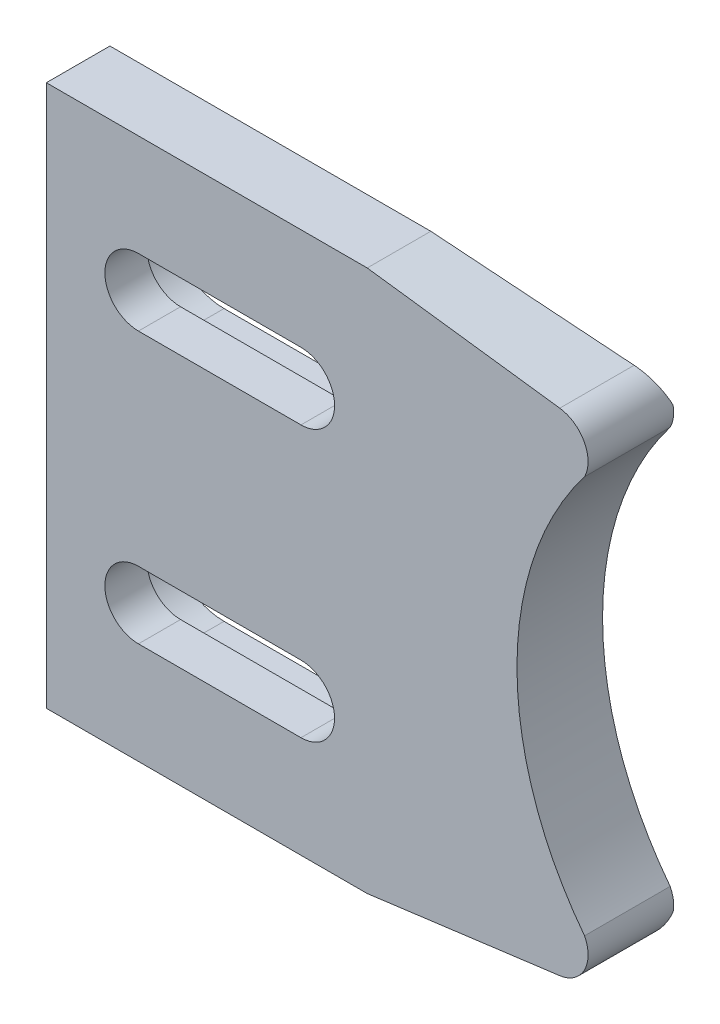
ISO-10303-21;
HEADER;
FILE_DESCRIPTION(('STEP AP214'),'2;1');
FILE_NAME('part.step','',(''),(''),'','','');
FILE_SCHEMA(('AUTOMOTIVE_DESIGN { 1 0 10303 214 1 1 1 1 }'));
ENDSEC;
DATA;
#1=APPLICATION_CONTEXT('core data for automotive mechanical design processes');
#2=APPLICATION_PROTOCOL_DEFINITION('international standard','automotive_design',2000,#1);
#3=PRODUCT_CONTEXT('',#1,'mechanical');
#4=PRODUCT('Part','Part','',(#3));
#5=PRODUCT_RELATED_PRODUCT_CATEGORY('part','',(#4));
#6=PRODUCT_DEFINITION_FORMATION('','',#4);
#7=PRODUCT_DEFINITION_CONTEXT('part definition',#1,'design');
#8=PRODUCT_DEFINITION('design','',#6,#7);
#9=PRODUCT_DEFINITION_SHAPE('','',#8);
#10=(LENGTH_UNIT() NAMED_UNIT(*) SI_UNIT(.MILLI.,.METRE.));
#11=(NAMED_UNIT(*) PLANE_ANGLE_UNIT() SI_UNIT($,.RADIAN.));
#12=(NAMED_UNIT(*) SI_UNIT($,.STERADIAN.) SOLID_ANGLE_UNIT());
#13=UNCERTAINTY_MEASURE_WITH_UNIT(LENGTH_MEASURE(1.E-05),#10,'distance_accuracy_value','');
#14=(GEOMETRIC_REPRESENTATION_CONTEXT(3) GLOBAL_UNCERTAINTY_ASSIGNED_CONTEXT((#13)) GLOBAL_UNIT_ASSIGNED_CONTEXT((#10,
#11,#12)) REPRESENTATION_CONTEXT('',''));
#15=CARTESIAN_POINT('',(0.,0.,0.));
#16=DIRECTION('',(0.,0.,1.));
#17=DIRECTION('',(1.,0.,0.));
#18=AXIS2_PLACEMENT_3D('',#15,#16,#17);
#19=CARTESIAN_POINT('',(39.8041591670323,-18.2457975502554,-8.19573333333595));
#20=DIRECTION('',(-0.608761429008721,0.793353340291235,0.));
#21=DIRECTION('',(-0.793353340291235,-0.608761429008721,0.));
#22=AXIS2_PLACEMENT_3D('',#19,#20,#21);
#23=PLANE('',#22);
#24=DIRECTION('',(-0.793353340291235,-0.608761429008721,0.));
#25=VECTOR('',#24,1.);
#26=CARTESIAN_POINT('',(40.4166916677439,-17.7757848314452,-7.8994));
#27=LINE('',#26,#25);
#28=CARTESIAN_POINT('',(40.4166927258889,-17.7757850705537,-7.89940091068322));
#29=VERTEX_POINT('',#28);
#30=CARTESIAN_POINT('',(39.1928196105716,-18.7148948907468,-7.89940085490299));
#31=VERTEX_POINT('',#30);
#32=EDGE_CURVE('E199',#29,#31,#27,.T.);
#33=ORIENTED_EDGE('',*,*,#32,.T.);
#34=CARTESIAN_POINT('',(40.416692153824,-17.7757844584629,-7.89940182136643));
#35=CARTESIAN_POINT('',(40.3649879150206,-17.8154585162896,-7.92137929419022));
#36=CARTESIAN_POINT('',(40.3125610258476,-17.8556870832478,-7.94055591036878));
#37=CARTESIAN_POINT('',(40.2066021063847,-17.9369922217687,-7.97320175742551));
#38=CARTESIAN_POINT('',(40.1530701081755,-17.9780687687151,-7.98667115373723));
#39=CARTESIAN_POINT('',(39.994284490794,-18.0999092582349,-8.01778127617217));
#40=CARTESIAN_POINT('',(39.8879620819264,-18.181493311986,-8.02733422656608));
#41=CARTESIAN_POINT('',(39.6830208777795,-18.3387502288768,-8.02422308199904));
#42=CARTESIAN_POINT('',(39.5843850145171,-18.4144361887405,-8.01307086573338));
#43=CARTESIAN_POINT('',(39.4371556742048,-18.5274092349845,-7.98187083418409));
#44=CARTESIAN_POINT('',(39.3875815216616,-18.5654488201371,-7.96879867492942));
#45=CARTESIAN_POINT('',(39.289403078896,-18.6407837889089,-7.93775414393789));
#46=CARTESIAN_POINT('',(39.2407988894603,-18.6780790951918,-7.91978126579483));
#47=CARTESIAN_POINT('',(39.1928193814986,-18.7148950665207,-7.89940170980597));
#48=B_SPLINE_CURVE_WITH_KNOTS('',3,(#34,#35,#36,#37,#38,#39,#40,#41,#42,#43,#44,#45,#46,#47),
.UNSPECIFIED.,.F.,.F.,(4,2,2,2,2,2,4),(0.,0.206206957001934,0.412407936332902,0.813480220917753,
1.18641030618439,1.37775101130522,1.56911149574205),.UNSPECIFIED.);
#49=EDGE_CURVE('E22',#29,#31,#48,.T.);
#50=ORIENTED_EDGE('',*,*,#49,.F.);
#51=EDGE_LOOP('',(#33,#50));
#52=FACE_BOUND('',#51,.T.);
#53=ADVANCED_FACE('F15',(#52),#23,.F.);
#54=CARTESIAN_POINT('',(38.4851074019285,-19.2675464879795,-7.34626868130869));
#55=CARTESIAN_POINT('',(38.5436848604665,-19.2226015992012,-7.41717273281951));
#56=CARTESIAN_POINT('',(38.6057650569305,-19.1749684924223,-7.48327261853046));
#57=CARTESIAN_POINT('',(38.7360697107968,-19.0749867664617,-7.60505480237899));
#58=CARTESIAN_POINT('',(38.8045115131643,-19.0224713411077,-7.66088763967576));
#59=CARTESIAN_POINT('',(38.9465137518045,-18.9135120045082,-7.76112453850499));
#60=CARTESIAN_POINT('',(39.0199622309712,-18.8571540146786,-7.80546635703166));
#61=CARTESIAN_POINT('',(39.1707564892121,-18.7414468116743,-7.88203669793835));
#62=CARTESIAN_POINT('',(39.2481254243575,-18.6820798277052,-7.91426751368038));
#63=CARTESIAN_POINT('',(39.4054749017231,-18.5613413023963,-7.96604701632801));
#64=CARTESIAN_POINT('',(39.4854475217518,-18.4999758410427,-7.98559690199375));
#65=CARTESIAN_POINT('',(39.6467208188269,-18.3762253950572,-8.01170705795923));
#66=CARTESIAN_POINT('',(39.7280227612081,-18.3138394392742,-8.01826648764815));
#67=CARTESIAN_POINT('',(39.8906294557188,-18.1890650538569,-8.01827963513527));
#68=CARTESIAN_POINT('',(39.9719328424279,-18.126677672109,-8.01173314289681));
#69=CARTESIAN_POINT('',(40.133209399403,-18.0029234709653,-7.98563693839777));
#70=CARTESIAN_POINT('',(40.2131838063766,-17.9415557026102,-7.96608779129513));
#71=CARTESIAN_POINT('',(40.3705305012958,-17.820816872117,-7.91428762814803));
#72=CARTESIAN_POINT('',(40.4478948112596,-17.7614519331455,-7.88203531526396));
#73=CARTESIAN_POINT('',(40.5986612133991,-17.6457626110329,-7.80539270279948));
#74=CARTESIAN_POINT('',(40.6720868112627,-17.5894201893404,-7.76100080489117));
#75=CARTESIAN_POINT('',(40.8140136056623,-17.4805143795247,-7.66063364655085));
#76=CARTESIAN_POINT('',(40.8824018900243,-17.4280376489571,-7.60472132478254));
#77=CARTESIAN_POINT('',(41.0127301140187,-17.3280328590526,-7.48258576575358));
#78=CARTESIAN_POINT('',(41.0748745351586,-17.2803478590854,-7.41618481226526));
#79=CARTESIAN_POINT('',(41.1360529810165,-17.2334045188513,-7.34179857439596));
#80=CARTESIAN_POINT('',(41.1386280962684,-17.2314285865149,-7.33864983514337));
#81=CARTESIAN_POINT('',(41.1411964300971,-17.2294578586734,-7.33549154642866));
#82=CARTESIAN_POINT('',(38.4821715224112,-19.2665976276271,-7.34807872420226));
#83=CARTESIAN_POINT('',(38.5408086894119,-19.2216058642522,-7.41905801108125));
#84=CARTESIAN_POINT('',(38.6029524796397,-19.1739230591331,-7.48522828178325));
#85=CARTESIAN_POINT('',(38.7333910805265,-19.0738370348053,-7.60714053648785));
#86=CARTESIAN_POINT('',(38.8019035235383,-19.021266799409,-7.66303326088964));
#87=CARTESIAN_POINT('',(38.9440528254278,-18.9121936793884,-7.76337814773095));
#88=CARTESIAN_POINT('',(39.0175776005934,-18.8557768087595,-7.80776800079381));
#89=CARTESIAN_POINT('',(39.1685289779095,-18.7399486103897,-7.8844218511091));
#90=CARTESIAN_POINT('',(39.2459787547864,-18.6805194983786,-7.91668813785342));
#91=CARTESIAN_POINT('',(39.4034930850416,-18.5596544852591,-7.96852534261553));
#92=CARTESIAN_POINT('',(39.4835497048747,-18.4982246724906,-7.98809745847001));
#93=CARTESIAN_POINT('',(39.6449928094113,-18.3743442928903,-8.0142384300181));
#94=CARTESIAN_POINT('',(39.7263805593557,-18.3118927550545,-8.02080644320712));
#95=CARTESIAN_POINT('',(39.8891592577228,-18.1869870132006,-8.02082290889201));
#96=CARTESIAN_POINT('',(39.9705488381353,-18.1245338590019,-8.01427115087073));
#97=CARTESIAN_POINT('',(40.131996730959,-18.0006489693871,-7.98815059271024));
#98=CARTESIAN_POINT('',(40.2120562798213,-17.9392162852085,-7.968582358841));
#99=CARTESIAN_POINT('',(40.3695708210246,-17.8183494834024,-7.91673043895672));
#100=CARTESIAN_POINT('',(40.4470178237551,-17.7589214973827,-7.88444545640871));
#101=CARTESIAN_POINT('',(40.5979456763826,-17.6431090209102,-7.80772444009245));
#102=CARTESIAN_POINT('',(40.6714500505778,-17.5867064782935,-7.76328681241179));
#103=CARTESIAN_POINT('',(40.8135294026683,-17.4776841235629,-7.6628156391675));
#104=CARTESIAN_POINT('',(40.8819913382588,-17.4251510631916,-7.60684509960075));
#105=CARTESIAN_POINT('',(41.0124601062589,-17.3250385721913,-7.48458188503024));
#106=CARTESIAN_POINT('',(41.0746716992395,-17.2773019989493,-7.41811125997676));
#107=CARTESIAN_POINT('',(41.1359163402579,-17.2303076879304,-7.34364674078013));
#108=CARTESIAN_POINT('',(41.1384942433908,-17.2283296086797,-7.34049468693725));
#109=CARTESIAN_POINT('',(41.1410653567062,-17.2263567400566,-7.33733307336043));
#110=CARTESIAN_POINT('',(38.4792356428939,-19.2656487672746,-7.34988876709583));
#111=CARTESIAN_POINT('',(38.5379325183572,-19.2206101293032,-7.42094328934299));
#112=CARTESIAN_POINT('',(38.6001399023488,-19.1728776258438,-7.48718394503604));
#113=CARTESIAN_POINT('',(38.7307124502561,-19.0726873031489,-7.60922627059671));
#114=CARTESIAN_POINT('',(38.7992955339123,-19.0200622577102,-7.66517888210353));
#115=CARTESIAN_POINT('',(38.9415918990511,-18.9108753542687,-7.7656317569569));
#116=CARTESIAN_POINT('',(39.0151929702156,-18.8543996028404,-7.81006964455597));
#117=CARTESIAN_POINT('',(39.166301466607,-18.7384504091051,-7.88680700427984));
#118=CARTESIAN_POINT('',(39.2438320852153,-18.6789591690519,-7.91910876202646));
#119=CARTESIAN_POINT('',(39.4015112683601,-18.5579676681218,-7.97100366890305));
#120=CARTESIAN_POINT('',(39.4816518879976,-18.4964735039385,-7.99059801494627));
#121=CARTESIAN_POINT('',(39.6432647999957,-18.3724631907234,-8.01676980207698));
#122=CARTESIAN_POINT('',(39.7247383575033,-18.3099460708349,-8.02334639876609));
#123=CARTESIAN_POINT('',(39.8876890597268,-18.1849089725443,-8.02336618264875));
#124=CARTESIAN_POINT('',(39.9691648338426,-18.1223900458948,-8.01680915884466));
#125=CARTESIAN_POINT('',(40.1307840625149,-17.9983744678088,-7.99066424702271));
#126=CARTESIAN_POINT('',(40.2109287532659,-17.9368768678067,-7.97107692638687));
#127=CARTESIAN_POINT('',(40.3686111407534,-17.8158820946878,-7.91917324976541));
#128=CARTESIAN_POINT('',(40.4461408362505,-17.7563910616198,-7.88685559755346));
#129=CARTESIAN_POINT('',(40.5972301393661,-17.6404554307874,-7.81005617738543));
#130=CARTESIAN_POINT('',(40.6708132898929,-17.5839927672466,-7.76557281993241));
#131=CARTESIAN_POINT('',(40.8130451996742,-17.4748538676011,-7.66499763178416));
#132=CARTESIAN_POINT('',(40.8815807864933,-17.4222644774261,-7.60896887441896));
#133=CARTESIAN_POINT('',(41.0121900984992,-17.32204428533,-7.4865780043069));
#134=CARTESIAN_POINT('',(41.0744688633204,-17.2742561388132,-7.42003770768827));
#135=CARTESIAN_POINT('',(41.1357796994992,-17.2272108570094,-7.3454949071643));
#136=CARTESIAN_POINT('',(41.1383603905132,-17.2252306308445,-7.34233953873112));
#137=CARTESIAN_POINT('',(41.1409342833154,-17.2232556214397,-7.3391746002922));
#138=CARTESIAN_POINT('',(38.4762997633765,-19.2646999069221,-7.35169880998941));
#139=CARTESIAN_POINT('',(38.5350563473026,-19.2196143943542,-7.42282856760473));
#140=CARTESIAN_POINT('',(38.597327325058,-19.1718321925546,-7.48913960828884));
#141=CARTESIAN_POINT('',(38.7280338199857,-19.0715375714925,-7.61131200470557));
#142=CARTESIAN_POINT('',(38.7966875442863,-19.0188577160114,-7.66732450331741));
#143=CARTESIAN_POINT('',(38.9391309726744,-18.909557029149,-7.76788536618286));
#144=CARTESIAN_POINT('',(39.0128083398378,-18.8530223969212,-7.81237128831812));
#145=CARTESIAN_POINT('',(39.1640739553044,-18.7369522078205,-7.88919215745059));
#146=CARTESIAN_POINT('',(39.2416854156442,-18.6773988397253,-7.9215293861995));
#147=CARTESIAN_POINT('',(39.3995294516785,-18.5562808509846,-7.97348199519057));
#148=CARTESIAN_POINT('',(39.4797540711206,-18.4947223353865,-7.99309857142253));
#149=CARTESIAN_POINT('',(39.6415367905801,-18.3705820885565,-8.01930117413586));
#150=CARTESIAN_POINT('',(39.723096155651,-18.3079993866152,-8.02588635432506));
#151=CARTESIAN_POINT('',(39.8862188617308,-18.182830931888,-8.02590945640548));
#152=CARTESIAN_POINT('',(39.9677808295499,-18.1202462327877,-8.01934716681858));
#153=CARTESIAN_POINT('',(40.1295713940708,-17.9960999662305,-7.99317790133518));
#154=CARTESIAN_POINT('',(40.2098012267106,-17.934537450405,-7.97357149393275));
#155=CARTESIAN_POINT('',(40.3676514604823,-17.8134147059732,-7.9216160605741));
#156=CARTESIAN_POINT('',(40.445263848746,-17.7538606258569,-7.88926573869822));
#157=CARTESIAN_POINT('',(40.5965146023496,-17.6378018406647,-7.8123879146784));
#158=CARTESIAN_POINT('',(40.670176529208,-17.5812790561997,-7.76785882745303));
#159=CARTESIAN_POINT('',(40.8125609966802,-17.4720236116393,-7.66717962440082));
#160=CARTESIAN_POINT('',(40.8811702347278,-17.4193778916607,-7.61109264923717));
#161=CARTESIAN_POINT('',(41.0119200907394,-17.3190499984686,-7.48857412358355));
#162=CARTESIAN_POINT('',(41.0742660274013,-17.2712102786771,-7.42196415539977));
#163=CARTESIAN_POINT('',(41.1356430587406,-17.2241140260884,-7.34734307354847));
#164=CARTESIAN_POINT('',(41.1382265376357,-17.2221316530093,-7.344184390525));
#165=CARTESIAN_POINT('',(41.1408032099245,-17.2201545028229,-7.34101612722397));
#166=CARTESIAN_POINT('',(38.1827118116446,-19.1698138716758,-7.53270309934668));
#167=CARTESIAN_POINT('',(38.2474392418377,-19.1200408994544,-7.61135639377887));
#168=CARTESIAN_POINT('',(38.3160695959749,-19.0672888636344,-7.68470593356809));
#169=CARTESIAN_POINT('',(38.4601707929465,-18.9565644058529,-7.81988541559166));
#170=CARTESIAN_POINT('',(38.5358885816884,-18.8984035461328,-7.88188662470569));
#171=CARTESIAN_POINT('',(38.6930383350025,-18.777724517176,-7.99324628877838));
#172=CARTESIAN_POINT('',(38.7743453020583,-18.7153018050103,-8.04253566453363));
#173=CARTESIAN_POINT('',(38.9413228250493,-18.587132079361,-8.12770747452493));
#174=CARTESIAN_POINT('',(39.0270184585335,-18.5213659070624,-8.16359180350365));
#175=CARTESIAN_POINT('',(39.2013477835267,-18.3875991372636,-8.22131462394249));
#176=CARTESIAN_POINT('',(39.2899723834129,-18.3196054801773,-8.24315421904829));
#177=CARTESIAN_POINT('',(39.4687358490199,-18.1824718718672,-8.2724383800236));
#178=CARTESIAN_POINT('',(39.5588759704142,-18.1133309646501,-8.27988191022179));
#179=CARTESIAN_POINT('',(39.739199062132,-17.9750268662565,-8.28023683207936));
#180=CARTESIAN_POINT('',(39.8293804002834,-17.9058649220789,-8.27314796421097));
#181=CARTESIAN_POINT('',(40.0083045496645,-17.7686498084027,-8.24454333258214));
#182=CARTESIAN_POINT('',(40.0970485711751,-17.7005957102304,-8.22302824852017));
#183=CARTESIAN_POINT('',(40.2716834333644,-17.5666758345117,-8.16589714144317));
#184=CARTESIAN_POINT('',(40.3575650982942,-17.5008170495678,-8.13027985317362));
#185=CARTESIAN_POINT('',(40.5249609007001,-17.3724428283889,-8.04556164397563));
#186=CARTESIAN_POINT('',(40.6065004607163,-17.3099079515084,-7.99645957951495));
#187=CARTESIAN_POINT('',(40.764140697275,-17.1889980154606,-7.88537888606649));
#188=CARTESIAN_POINT('',(40.8401150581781,-17.1307193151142,-7.82347013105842));
#189=CARTESIAN_POINT('',(40.9849193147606,-17.0196213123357,-7.68818605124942));
#190=CARTESIAN_POINT('',(41.0539824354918,-16.9666242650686,-7.61460892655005));
#191=CARTESIAN_POINT('',(41.1219789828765,-16.9144309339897,-7.53215971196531));
#192=CARTESIAN_POINT('',(41.124841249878,-16.912233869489,-7.52866956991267));
#193=CARTESIAN_POINT('',(41.1276958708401,-16.9100426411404,-7.5251688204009));
#194=CARTESIAN_POINT('',(37.8891238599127,-19.0749278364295,-7.71370738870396));
#195=CARTESIAN_POINT('',(37.9598257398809,-19.0204647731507,-7.79988638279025));
#196=CARTESIAN_POINT('',(38.0348089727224,-18.9627476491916,-7.88027003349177));
#197=CARTESIAN_POINT('',(38.1923126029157,-18.8415877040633,-8.02846293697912));
#198=CARTESIAN_POINT('',(38.2750921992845,-18.7779474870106,-8.09645073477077));
#199=CARTESIAN_POINT('',(38.4469453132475,-18.6458922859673,-8.21860780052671));
#200=CARTESIAN_POINT('',(38.5358832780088,-18.5775804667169,-8.2727016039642));
#201=CARTESIAN_POINT('',(38.7185723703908,-18.4373114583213,-8.36622377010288));
#202=CARTESIAN_POINT('',(38.8123523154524,-18.3653323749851,-8.40565551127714));
#203=CARTESIAN_POINT('',(39.00316636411,-18.2189172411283,-8.46914835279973));
#204=CARTESIAN_POINT('',(39.1001910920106,-18.1444883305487,-8.49321108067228));
#205=CARTESIAN_POINT('',(39.2959350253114,-17.9943615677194,-8.5255766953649));
#206=CARTESIAN_POINT('',(39.3946559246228,-17.918662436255,-8.53387862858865));
#207=CARTESIAN_POINT('',(39.592179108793,-17.7672229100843,-8.53456536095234));
#208=CARTESIAN_POINT('',(39.6909798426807,-17.6914837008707,-8.52694989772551));
#209=CARTESIAN_POINT('',(39.8870372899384,-17.5411999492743,-8.49590998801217));
#210=CARTESIAN_POINT('',(39.9842956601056,-17.4666541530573,-8.47248614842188));
#211=CARTESIAN_POINT('',(40.1757145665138,-17.3199375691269,-8.4101795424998));
#212=CARTESIAN_POINT('',(40.2698656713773,-17.2477739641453,-8.37129500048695));
#213=CARTESIAN_POINT('',(40.4534061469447,-17.1070845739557,-8.27873699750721));
#214=CARTESIAN_POINT('',(40.5428248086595,-17.0385365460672,-8.22506099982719));
#215=CARTESIAN_POINT('',(40.7157177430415,-16.9059743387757,-8.10358021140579));
#216=CARTESIAN_POINT('',(40.7990549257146,-16.8420643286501,-8.03585186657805));
#217=CARTESIAN_POINT('',(40.9579215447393,-16.7201904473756,-7.8877957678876));
#218=CARTESIAN_POINT('',(41.033695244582,-16.6620408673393,-7.80725606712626));
#219=CARTESIAN_POINT('',(41.1083150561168,-16.6047477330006,-7.7169763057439));
#220=CARTESIAN_POINT('',(41.1114558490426,-16.6023361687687,-7.71315476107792));
#221=CARTESIAN_POINT('',(41.1145885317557,-16.5999307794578,-7.70932151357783));
#222=CARTESIAN_POINT('',(37.5955359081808,-18.9800418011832,-7.89471167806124));
#223=CARTESIAN_POINT('',(37.672208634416,-18.9208912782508,-7.98841420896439));
#224=CARTESIAN_POINT('',(37.7535512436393,-18.8582043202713,-8.07583635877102));
#225=CARTESIAN_POINT('',(37.9244495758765,-18.7266145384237,-8.23703634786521));
#226=CARTESIAN_POINT('',(38.0142932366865,-18.657493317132,-8.31101285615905));
#227=CARTESIAN_POINT('',(38.2008526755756,-18.5140597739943,-8.44396872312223));
#228=CARTESIAN_POINT('',(38.2974202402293,-18.4398598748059,-8.50286598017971));
#229=CARTESIAN_POINT('',(38.4958212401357,-18.2874913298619,-8.60473908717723));
#230=CARTESIAN_POINT('',(38.5976853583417,-18.2092994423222,-8.6477179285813));
#231=CARTESIAN_POINT('',(38.8049846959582,-18.0502355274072,-8.71698098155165));
#232=CARTESIAN_POINT('',(38.9104094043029,-17.9693714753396,-8.74326672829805));
#233=CARTESIAN_POINT('',(39.1231340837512,-17.8062513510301,-8.77871390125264));
#234=CARTESIAN_POINT('',(39.230435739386,-17.7239940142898,-8.78787418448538));
#235=CARTESIAN_POINT('',(39.4451593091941,-17.5594188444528,-8.78889273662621));
#236=CARTESIAN_POINT('',(39.5525794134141,-17.4771023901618,-8.7807506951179));
#237=CARTESIAN_POINT('',(39.7657704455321,-17.3137497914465,-8.74727541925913));
#238=CARTESIAN_POINT('',(39.8715430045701,-17.2327124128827,-8.7219429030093));
#239=CARTESIAN_POINT('',(40.0797465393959,-17.0731986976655,-8.65446062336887));
#240=CARTESIAN_POINT('',(40.1821669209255,-16.9947303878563,-8.61230911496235));
#241=CARTESIAN_POINT('',(40.3818524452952,-16.8417255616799,-8.51191072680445));
#242=CARTESIAN_POINT('',(40.4791487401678,-16.7671654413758,-8.45366175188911));
#243=CARTESIAN_POINT('',(40.6672974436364,-16.6229487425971,-8.32177947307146));
#244=CARTESIAN_POINT('',(40.7579997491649,-16.5534057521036,-8.2482293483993));
#245=CARTESIAN_POINT('',(40.9309207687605,-16.4207617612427,-8.08740769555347));
#246=CARTESIAN_POINT('',(41.0134116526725,-16.3574548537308,-7.99990083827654));
#247=CARTESIAN_POINT('',(41.0946509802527,-16.2950646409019,-7.90179294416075));
#248=CARTESIAN_POINT('',(41.098070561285,-16.2924383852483,-7.89763994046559));
#249=CARTESIAN_POINT('',(41.1014811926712,-16.2898189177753,-7.89347420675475));
#250=CARTESIAN_POINT('',(37.5925706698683,-18.9790834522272,-7.89653982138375));
#251=CARTESIAN_POINT('',(37.6693037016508,-18.9198855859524,-7.99031834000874));
#252=CARTESIAN_POINT('',(37.7507105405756,-18.8571484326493,-8.07781157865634));
#253=CARTESIAN_POINT('',(37.9217441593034,-18.7254533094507,-8.23914293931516));
#254=CARTESIAN_POINT('',(38.0116591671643,-18.6562767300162,-8.31317993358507));
#255=CARTESIAN_POINT('',(38.1983671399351,-18.5127282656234,-8.44624486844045));
#256=CARTESIAN_POINT('',(38.2950117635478,-18.4384688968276,-8.50519064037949));
#257=CARTESIAN_POINT('',(38.4935714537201,-18.2859781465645,-8.60714809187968));
#258=CARTESIAN_POINT('',(38.5955172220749,-18.2077235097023,-8.65016275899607));
#259=CARTESIAN_POINT('',(38.8029830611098,-18.0485318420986,-8.71948409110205));
#260=CARTESIAN_POINT('',(38.9084926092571,-17.967602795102,-8.74579229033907));
#261=CARTESIAN_POINT('',(39.1213887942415,-17.8043514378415,-8.78127058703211));
#262=CARTESIAN_POINT('',(39.2287771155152,-17.722027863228,-8.79043953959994));
#263=CARTESIAN_POINT('',(39.4436744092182,-17.55732002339,-8.79146144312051));
#264=CARTESIAN_POINT('',(39.5511815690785,-17.4749371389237,-8.78331408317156));
#265=CARTESIAN_POINT('',(39.7645456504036,-17.3114525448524,-8.74981421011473));
#266=CARTESIAN_POINT('',(39.8704042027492,-17.2303496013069,-8.72446241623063));
#267=CARTESIAN_POINT('',(40.078777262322,-17.0707066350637,-8.65692786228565));
#268=CARTESIAN_POINT('',(40.181281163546,-16.9921746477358,-8.61474335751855));
#269=CARTESIAN_POINT('',(40.3811297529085,-16.8390454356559,-8.51426578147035));
#270=CARTESIAN_POINT('',(40.478505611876,-16.7644245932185,-8.45597061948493));
#271=CARTESIAN_POINT('',(40.6668083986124,-16.6200901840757,-8.32398328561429));
#272=CARTESIAN_POINT('',(40.7575850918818,-16.5504903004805,-8.25037436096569));
#273=CARTESIAN_POINT('',(40.9306480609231,-16.4177375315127,-8.0894237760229));
#274=CARTESIAN_POINT('',(41.0132067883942,-16.3543785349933,-8.00184655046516));
#275=CARTESIAN_POINT('',(41.0945129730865,-16.2919368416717,-7.90365959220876));
#276=CARTESIAN_POINT('',(41.0979353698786,-16.2893084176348,-7.89950324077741));
#277=CARTESIAN_POINT('',(41.1013488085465,-16.2866867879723,-7.89533414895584));
#278=CARTESIAN_POINT('',(37.5896054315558,-18.9781251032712,-7.89836796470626));
#279=CARTESIAN_POINT('',(37.6663987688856,-18.9188798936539,-7.9922224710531));
#280=CARTESIAN_POINT('',(37.7478698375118,-18.8560925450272,-8.07978679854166));
#281=CARTESIAN_POINT('',(37.9190387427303,-18.7242920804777,-8.24124953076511));
#282=CARTESIAN_POINT('',(38.0090250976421,-18.6550601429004,-8.31534701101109));
#283=CARTESIAN_POINT('',(38.1958816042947,-18.5113967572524,-8.44852101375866));
#284=CARTESIAN_POINT('',(38.2926032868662,-18.4370779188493,-8.50751530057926));
#285=CARTESIAN_POINT('',(38.4913216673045,-18.284464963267,-8.60955709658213));
#286=CARTESIAN_POINT('',(38.593349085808,-18.2061475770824,-8.65260758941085));
#287=CARTESIAN_POINT('',(38.8009814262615,-18.04682815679,-8.72198720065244));
#288=CARTESIAN_POINT('',(38.9065758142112,-17.9658341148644,-8.74831785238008));
#289=CARTESIAN_POINT('',(39.1196435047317,-17.8024515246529,-8.78382727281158));
#290=CARTESIAN_POINT('',(39.2271184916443,-17.7200617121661,-8.79300489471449));
#291=CARTESIAN_POINT('',(39.4421895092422,-17.5552212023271,-8.79403014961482));
#292=CARTESIAN_POINT('',(39.5497837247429,-17.4727718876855,-8.78587747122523));
#293=CARTESIAN_POINT('',(39.7633208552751,-17.3091552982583,-8.75235300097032));
#294=CARTESIAN_POINT('',(39.8692654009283,-17.2279867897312,-8.72698192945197));
#295=CARTESIAN_POINT('',(40.0778079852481,-17.0682145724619,-8.65939510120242));
#296=CARTESIAN_POINT('',(40.1803954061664,-16.9896189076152,-8.61717760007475));
#297=CARTESIAN_POINT('',(40.3804070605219,-16.8363653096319,-8.51662083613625));
#298=CARTESIAN_POINT('',(40.4778624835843,-16.7616837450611,-8.45827948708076));
#299=CARTESIAN_POINT('',(40.6663193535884,-16.6172316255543,-8.32618709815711));
#300=CARTESIAN_POINT('',(40.7571704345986,-16.5475748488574,-8.25251937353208));
#301=CARTESIAN_POINT('',(40.9303753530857,-16.4147133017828,-8.09143985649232));
#302=CARTESIAN_POINT('',(41.0130019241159,-16.3513022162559,-8.00379226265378));
#303=CARTESIAN_POINT('',(41.0943749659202,-16.2888090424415,-7.90552624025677));
#304=CARTESIAN_POINT('',(41.0978001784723,-16.2861784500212,-7.90136654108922));
#305=CARTESIAN_POINT('',(41.1012164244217,-16.2835546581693,-7.89719409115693));
#306=CARTESIAN_POINT('',(37.5866401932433,-18.9771667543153,-7.90019610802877));
#307=CARTESIAN_POINT('',(37.6634938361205,-18.9178742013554,-7.99412660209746));
#308=CARTESIAN_POINT('',(37.7450291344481,-18.8550366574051,-8.08176201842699));
#309=CARTESIAN_POINT('',(37.9163333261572,-18.7231308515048,-8.24335612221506));
#310=CARTESIAN_POINT('',(38.0063910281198,-18.6538435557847,-8.31751408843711));
#311=CARTESIAN_POINT('',(38.1933960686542,-18.5100652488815,-8.45079715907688));
#312=CARTESIAN_POINT('',(38.2901948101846,-18.435686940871,-8.50983996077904));
#313=CARTESIAN_POINT('',(38.489071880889,-18.2829517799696,-8.61196610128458));
#314=CARTESIAN_POINT('',(38.5911809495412,-18.2045716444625,-8.65505241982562));
#315=CARTESIAN_POINT('',(38.7989797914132,-18.0451244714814,-8.72449031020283));
#316=CARTESIAN_POINT('',(38.9046590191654,-17.9640654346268,-8.75084341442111));
#317=CARTESIAN_POINT('',(39.117898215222,-17.8005516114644,-8.78638395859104));
#318=CARTESIAN_POINT('',(39.2254598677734,-17.7180955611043,-8.79557024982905));
#319=CARTESIAN_POINT('',(39.4407046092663,-17.5531223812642,-8.79659885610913));
#320=CARTESIAN_POINT('',(39.5483858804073,-17.4706066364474,-8.78844085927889));
#321=CARTESIAN_POINT('',(39.7620960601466,-17.3068580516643,-8.75489179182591));
#322=CARTESIAN_POINT('',(39.8681265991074,-17.2256239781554,-8.7295014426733));
#323=CARTESIAN_POINT('',(40.0768387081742,-17.0657225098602,-8.6618623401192));
#324=CARTESIAN_POINT('',(40.1795096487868,-16.9870631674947,-8.61961184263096));
#325=CARTESIAN_POINT('',(40.3796843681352,-16.8336851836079,-8.51897589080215));
#326=CARTESIAN_POINT('',(40.4772193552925,-16.7589428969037,-8.46058835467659));
#327=CARTESIAN_POINT('',(40.6658303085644,-16.6143730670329,-8.32839091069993));
#328=CARTESIAN_POINT('',(40.7567557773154,-16.5446593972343,-8.25466438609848));
#329=CARTESIAN_POINT('',(40.9301026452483,-16.4116890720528,-8.09345593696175));
#330=CARTESIAN_POINT('',(41.0127970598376,-16.3482258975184,-8.0057379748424));
#331=CARTESIAN_POINT('',(41.094236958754,-16.2856812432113,-7.90739288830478));
#332=CARTESIAN_POINT('',(41.0976649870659,-16.2830484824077,-7.90322984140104));
#333=CARTESIAN_POINT('',(41.1010840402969,-16.2804225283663,-7.89905403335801));
#334=B_SPLINE_SURFACE_WITH_KNOTS('',3,3,((#54,#55,#56,#57,#58,#59,#60,#61,#62,#63,#64,#65,#66,
#67,#68,#69,#70,#71,#72,#73,#74,#75,#76,#77,#78,#79,#80,#81),(#82,#83,#84,#85,#86,#87,#88,#89,
#90,#91,#92,#93,#94,#95,#96,#97,#98,#99,#100,#101,#102,#103,#104,#105,#106,#107,#108,#109),
(#110,#111,#112,#113,#114,#115,#116,#117,#118,#119,#120,#121,#122,#123,#124,#125,#126,#127,#128,
#129,#130,#131,#132,#133,#134,#135,#136,#137),(#138,#139,#140,#141,#142,#143,#144,#145,#146,
#147,#148,#149,#150,#151,#152,#153,#154,#155,#156,#157,#158,#159,#160,#161,#162,#163,#164,#165),
(#166,#167,#168,#169,#170,#171,#172,#173,#174,#175,#176,#177,#178,#179,#180,#181,#182,#183,#184,
#185,#186,#187,#188,#189,#190,#191,#192,#193),(#194,#195,#196,#197,#198,#199,#200,#201,#202,
#203,#204,#205,#206,#207,#208,#209,#210,#211,#212,#213,#214,#215,#216,#217,#218,#219,#220,#221),
(#222,#223,#224,#225,#226,#227,#228,#229,#230,#231,#232,#233,#234,#235,#236,#237,#238,#239,#240,
#241,#242,#243,#244,#245,#246,#247,#248,#249),(#250,#251,#252,#253,#254,#255,#256,#257,#258,
#259,#260,#261,#262,#263,#264,#265,#266,#267,#268,#269,#270,#271,#272,#273,#274,#275,#276,#277),
(#278,#279,#280,#281,#282,#283,#284,#285,#286,#287,#288,#289,#290,#291,#292,#293,#294,#295,#296,
#297,#298,#299,#300,#301,#302,#303,#304,#305),(#306,#307,#308,#309,#310,#311,#312,#313,#314,
#315,#316,#317,#318,#319,#320,#321,#322,#323,#324,#325,#326,#327,#328,#329,#330,#331,#332,
#333)),.UNSPECIFIED.,.F.,.F.,.F.,(4,3,3,4),(4,2,2,2,2,2,2,2,2,2,2,2,2,4),(-0.01,0.,1.,1.0101),
(8.5837463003E-05,0.030830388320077,0.061656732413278,0.092480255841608,0.123302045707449,
0.154123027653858,0.1849439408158,0.215765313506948,0.246587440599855,0.277410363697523,
0.308233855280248,0.33905740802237,0.369880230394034,0.371238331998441),.UNSPECIFIED.);
#335=CARTESIAN_POINT('',(41.0966164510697,-16.2935551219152,-7.8994));
#336=CARTESIAN_POINT('',(41.0684595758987,-16.380199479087,-7.89940000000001));
#337=CARTESIAN_POINT('',(41.0392884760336,-16.4665336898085,-7.89940000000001));
#338=CARTESIAN_POINT('',(40.9783258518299,-16.6384351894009,-7.8994));
#339=CARTESIAN_POINT('',(40.9465299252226,-16.7240009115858,-7.8994));
#340=CARTESIAN_POINT('',(40.88018566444,-16.8929845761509,-7.8994));
#341=CARTESIAN_POINT('',(40.8456714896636,-16.9764157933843,-7.8994));
#342=CARTESIAN_POINT('',(40.7729491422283,-17.1415668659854,-7.89940000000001));
#343=CARTESIAN_POINT('',(40.7347445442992,-17.2232882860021,-7.8994));
#344=CARTESIAN_POINT('',(40.6533379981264,-17.385413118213,-7.8994));
#345=CARTESIAN_POINT('',(40.6100839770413,-17.4657908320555,-7.8994));
#346=CARTESIAN_POINT('',(40.5178872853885,-17.6234298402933,-7.8994));
#347=CARTESIAN_POINT('',(40.4689324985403,-17.7006840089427,-7.89940000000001));
#348=CARTESIAN_POINT('',(40.4166932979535,-17.775785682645,-7.89940000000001));
#349=B_SPLINE_CURVE_WITH_KNOTS('',3,(#335,#336,#337,#338,#339,#340,#341,#342,#343,#344,#345,
#346,#347,#348),.UNSPECIFIED.,.F.,.F.,(4,2,2,2,2,2,4),(0.,0.273335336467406,0.547138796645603,
0.817927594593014,1.08845667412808,1.36207425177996,1.63628436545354),.UNSPECIFIED.);
#350=CARTESIAN_POINT('',(41.0966164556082,-16.2935551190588,-7.89940000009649));
#351=VERTEX_POINT('',#350);
#352=EDGE_CURVE('E204',#351,#29,#349,.T.);
#353=CARTESIAN_POINT('',(39.1928202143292,-18.7148964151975,-7.89940000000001));
#354=CARTESIAN_POINT('',(39.1073710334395,-18.7454757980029,-7.89940000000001));
#355=CARTESIAN_POINT('',(39.0206931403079,-18.7722947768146,-7.89940000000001));
#356=CARTESIAN_POINT('',(38.8458043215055,-18.8195415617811,-7.8994));
#357=CARTESIAN_POINT('',(38.7575972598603,-18.8399835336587,-7.8994));
#358=CARTESIAN_POINT('',(38.5812140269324,-18.8755249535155,-7.8994));
#359=CARTESIAN_POINT('',(38.4930493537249,-18.8906835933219,-7.8994));
#360=CARTESIAN_POINT('',(38.3160391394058,-18.9169536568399,-7.8994));
#361=CARTESIAN_POINT('',(38.2271930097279,-18.9280610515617,-7.8994));
#362=CARTESIAN_POINT('',(38.0485468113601,-18.9470518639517,-7.8994));
#363=CARTESIAN_POINT('',(37.9587443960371,-18.954912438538,-7.8994));
#364=CARTESIAN_POINT('',(37.7790975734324,-18.9678909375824,-7.8994));
#365=CARTESIAN_POINT('',(37.6892535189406,-18.9730136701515,-7.8994));
#366=CARTESIAN_POINT('',(37.5993803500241,-18.977075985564,-7.8994));
#367=B_SPLINE_CURVE_WITH_KNOTS('',3,(#353,#354,#355,#356,#357,#358,#359,#360,#361,#362,#363,
#364,#365,#366),.UNSPECIFIED.,.F.,.F.,(4,2,2,2,2,2,4),(0.,0.272023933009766,0.543439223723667,
0.811707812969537,1.08024247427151,1.35063549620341,1.62055208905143),.UNSPECIFIED.);
#368=CARTESIAN_POINT('',(37.5993803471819,-18.9770759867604,-7.89939999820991));
#369=VERTEX_POINT('',#368);
#370=EDGE_CURVE('E203',#31,#369,#367,.T.);
#371=CARTESIAN_POINT('',(41.0966164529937,-16.2935551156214,-7.89940000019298));
#372=CARTESIAN_POINT('',(41.0455980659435,-16.3327366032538,-7.96139034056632));
#373=CARTESIAN_POINT('',(40.9924894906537,-16.3735047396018,-8.02065115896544));
#374=CARTESIAN_POINT('',(40.8824915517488,-16.4579125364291,-8.13332393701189));
#375=CARTESIAN_POINT('',(40.825602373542,-16.5015520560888,-8.18673618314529));
#376=CARTESIAN_POINT('',(40.7084811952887,-16.5913714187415,-8.28729084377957));
#377=CARTESIAN_POINT('',(40.6482517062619,-16.6375493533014,-8.33443787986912));
#378=CARTESIAN_POINT('',(40.5248666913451,-16.7321284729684,-8.42216876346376));
#379=CARTESIAN_POINT('',(40.4617112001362,-16.7805296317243,-8.46275268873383));
#380=CARTESIAN_POINT('',(40.2684432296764,-16.9286322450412,-8.57424306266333));
#381=CARTESIAN_POINT('',(40.1344875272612,-17.0312648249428,-8.63492386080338));
#382=CARTESIAN_POINT('',(39.8604875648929,-17.241190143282,-8.72704826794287));
#383=CARTESIAN_POINT('',(39.7204445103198,-17.3484819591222,-8.7584976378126));
#384=CARTESIAN_POINT('',(39.4381367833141,-17.5648042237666,-8.79135389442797));
#385=CARTESIAN_POINT('',(39.2958718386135,-17.6738348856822,-8.79275706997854));
#386=CARTESIAN_POINT('',(39.0131704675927,-17.8905656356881,-8.76544596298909));
#387=CARTESIAN_POINT('',(38.8727345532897,-17.9982653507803,-8.73672342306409));
#388=CARTESIAN_POINT('',(38.5977004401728,-18.2092871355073,-8.64997083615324));
#389=CARTESIAN_POINT('',(38.4631040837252,-18.3126078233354,-8.59193161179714));
#390=CARTESIAN_POINT('',(38.2036828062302,-18.511877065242,-8.44818260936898));
#391=CARTESIAN_POINT('',(38.0788494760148,-18.6078319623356,-8.36249697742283));
#392=CARTESIAN_POINT('',(37.8961398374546,-18.7484104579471,-8.21060453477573));
#393=CARTESIAN_POINT('',(37.8335513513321,-18.7965944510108,-8.15316034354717));
#394=CARTESIAN_POINT('',(37.7129546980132,-18.8894945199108,-8.03135831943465));
#395=CARTESIAN_POINT('',(37.6549389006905,-18.9342163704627,-7.96701244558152));
#396=CARTESIAN_POINT('',(37.5993803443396,-18.9770759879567,-7.89939999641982));
#397=B_SPLINE_CURVE_WITH_KNOTS('',3,(#371,#372,#373,#374,#375,#376,#377,#378,#379,#380,#381,
#382,#383,#384,#385,#386,#387,#388,#389,#390,#391,#392,#393,#394,#395,#396),.UNSPECIFIED.,.F.,
.F.,(4,2,2,2,2,2,2,2,2,2,2,2,4),(0.,0.267919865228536,0.535826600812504,0.803534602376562,
1.07123943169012,1.60646075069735,2.14157656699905,2.67675847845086,3.21208712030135,
3.74758344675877,4.28261333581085,4.57524650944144,4.86738056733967),.UNSPECIFIED.);
#398=EDGE_CURVE('E334',#351,#369,#397,.T.);
#399=ORIENTED_EDGE('',*,*,#352,.T.);
#400=ORIENTED_EDGE('',*,*,#49,.T.);
#401=ORIENTED_EDGE('',*,*,#370,.T.);
#402=ORIENTED_EDGE('',*,*,#398,.F.);
#403=EDGE_LOOP('',(#399,#400,#401,#402));
#404=FACE_BOUND('',#403,.T.);
#405=ADVANCED_FACE('F207',(#404),#334,.T.);
#406=CARTESIAN_POINT('',(38.0561100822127,19.5871227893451,-7.89940000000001));
#407=DIRECTION('',(0.608761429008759,0.793353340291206,0.));
#408=DIRECTION('',(-0.793353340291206,0.608761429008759,0.));
#409=AXIS2_PLACEMENT_3D('',#406,#407,#408);
#410=PLANE('',#409);
#411=CARTESIAN_POINT('',(39.1928193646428,18.7148950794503,-7.8994017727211));
#412=CARTESIAN_POINT('',(39.2446026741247,18.6751603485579,-7.92139528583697));
#413=CARTESIAN_POINT('',(39.2971086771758,18.6348710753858,-7.94058590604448));
#414=CARTESIAN_POINT('',(39.4032269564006,18.5534436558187,-7.97325245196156));
#415=CARTESIAN_POINT('',(39.4568392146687,18.5123055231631,-7.98672847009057));
#416=CARTESIAN_POINT('',(39.6158575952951,18.3902864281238,-8.01784078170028));
#417=CARTESIAN_POINT('',(39.7223335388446,18.3085845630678,-8.0273748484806));
#418=CARTESIAN_POINT('',(39.9272733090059,18.1513287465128,-8.02416906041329));
#419=CARTESIAN_POINT('',(40.02575536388,18.0757608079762,-8.01300230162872));
#420=CARTESIAN_POINT('',(40.1727520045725,17.9629663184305,-7.98180882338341));
#421=CARTESIAN_POINT('',(40.222246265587,17.9249880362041,-7.96874427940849));
#422=CARTESIAN_POINT('',(40.3202659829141,17.8497748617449,-7.93772227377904));
#423=CARTESIAN_POINT('',(40.3687913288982,17.8125400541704,-7.91976425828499));
#424=CARTESIAN_POINT('',(40.4166921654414,17.775784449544,-7.8994018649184));
#425=B_SPLINE_CURVE_WITH_KNOTS('',3,(#411,#412,#413,#414,#415,#416,#417,#418,#419,#420,#421,
#422,#423,#424),.UNSPECIFIED.,.F.,.F.,(4,2,2,2,2,2,4),(0.,0.206505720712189,0.413008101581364,
0.814648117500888,1.18700867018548,1.37804914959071,1.56911125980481),.UNSPECIFIED.);
#426=CARTESIAN_POINT('',(39.1928197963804,18.7148957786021,-7.89940088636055));
#427=VERTEX_POINT('',#426);
#428=CARTESIAN_POINT('',(40.4166919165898,17.7757846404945,-7.8994009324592));
#429=VERTEX_POINT('',#428);
#430=EDGE_CURVE('E209',#427,#429,#425,.T.);
#431=ORIENTED_EDGE('',*,*,#430,.F.);
#432=DIRECTION('',(0.793353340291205,-0.608761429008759,0.));
#433=VECTOR('',#432,1.);
#434=CARTESIAN_POINT('',(39.192819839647,18.7148947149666,-7.8994));
#435=LINE('',#434,#433);
#436=EDGE_CURVE('E254',#427,#429,#435,.T.);
#437=ORIENTED_EDGE('',*,*,#436,.T.);
#438=EDGE_LOOP('',(#431,#437));
#439=FACE_BOUND('',#438,.T.);
#440=ADVANCED_FACE('F325',(#439),#410,.T.);
#441=CARTESIAN_POINT('',(37.5856827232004,18.9779054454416,-7.89902526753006));
#442=CARTESIAN_POINT('',(37.6628171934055,18.9183956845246,-7.99339911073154));
#443=CARTESIAN_POINT('',(37.7446738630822,18.8553102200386,-8.08142692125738));
#444=CARTESIAN_POINT('',(37.9163335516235,18.7231306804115,-8.24335638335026));
#445=CARTESIAN_POINT('',(38.0063911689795,18.6538434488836,-8.31751426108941));
#446=CARTESIAN_POINT('',(38.1933962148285,18.5100651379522,-8.45079733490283));
#447=CARTESIAN_POINT('',(38.290194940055,18.4356868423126,-8.50984011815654));
#448=CARTESIAN_POINT('',(38.4890720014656,18.2829516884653,-8.61196624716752));
#449=CARTESIAN_POINT('',(38.5911810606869,18.204571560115,-8.65505255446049));
#450=CARTESIAN_POINT('',(38.7989798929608,18.0451243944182,-8.72449043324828));
#451=CARTESIAN_POINT('',(38.904659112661,17.9640653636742,-8.75084352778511));
#452=CARTESIAN_POINT('',(39.1178982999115,17.8005515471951,-8.78638406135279));
#453=CARTESIAN_POINT('',(39.2254599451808,17.7180955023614,-8.79557034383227));
#454=CARTESIAN_POINT('',(39.4407046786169,17.5531223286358,-8.79659894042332));
#455=CARTESIAN_POINT('',(39.5483859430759,17.47060658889,-8.78844093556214));
#456=CARTESIAN_POINT('',(39.7620961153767,17.3068580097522,-8.75489185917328));
#457=CARTESIAN_POINT('',(39.8681266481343,17.225623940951,-8.72950150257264));
#458=CARTESIAN_POINT('',(40.0768387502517,17.0657224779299,-8.66186239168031));
#459=CARTESIAN_POINT('',(40.1795096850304,16.9870631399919,-8.61961188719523));
#460=CARTESIAN_POINT('',(40.3796843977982,16.8336851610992,-8.51897592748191));
#461=CARTESIAN_POINT('',(40.4772193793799,16.7589428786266,-8.46058838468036));
#462=CARTESIAN_POINT('',(40.6658303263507,16.6143730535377,-8.32839093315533));
#463=CARTESIAN_POINT('',(40.7567557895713,16.5446593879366,-8.25466440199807));
#464=CARTESIAN_POINT('',(40.9301026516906,16.4116890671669,-8.09345594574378));
#465=CARTESIAN_POINT('',(41.0127970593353,16.3482258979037,-8.00573797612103));
#466=CARTESIAN_POINT('',(41.0938606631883,16.2859702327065,-7.90784729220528));
#467=CARTESIAN_POINT('',(41.0969142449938,16.2836250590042,-7.90414127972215));
#468=CARTESIAN_POINT('',(41.0999607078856,16.2812852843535,-7.90042514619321));
#469=CARTESIAN_POINT('',(37.5886487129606,18.9788632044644,-7.89719807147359));
#470=CARTESIAN_POINT('',(37.6657226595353,18.9194009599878,-7.9914955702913));
#471=CARTESIAN_POINT('',(37.7475148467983,18.8563658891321,-8.07945197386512));
#472=CARTESIAN_POINT('',(37.9190389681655,18.7242919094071,-8.24124979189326));
#473=CARTESIAN_POINT('',(38.009025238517,18.6550600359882,-8.31534718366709));
#474=CARTESIAN_POINT('',(38.1958817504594,18.5113966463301,-8.44852118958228));
#475=CARTESIAN_POINT('',(38.2926034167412,18.4370778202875,-8.50751545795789));
#476=CARTESIAN_POINT('',(38.4913217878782,18.2844648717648,-8.60955724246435));
#477=CARTESIAN_POINT('',(38.5933491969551,18.2061474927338,-8.65260772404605));
#478=CARTESIAN_POINT('',(38.8009815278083,18.0468280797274,-8.72198732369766));
#479=CARTESIAN_POINT('',(38.9065759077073,17.9658340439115,-8.74831796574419));
#480=CARTESIAN_POINT('',(39.119643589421,17.8024514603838,-8.78382737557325));
#481=CARTESIAN_POINT('',(39.2271185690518,17.7200616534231,-8.79300498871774));
#482=CARTESIAN_POINT('',(39.4421895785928,17.5552211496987,-8.79403023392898));
#483=CARTESIAN_POINT('',(39.5497837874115,17.4727718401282,-8.78587754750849));
#484=CARTESIAN_POINT('',(39.7633209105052,17.3091552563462,-8.75235306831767));
#485=CARTESIAN_POINT('',(39.8692654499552,17.2279867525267,-8.72698198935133));
#486=CARTESIAN_POINT('',(40.0778080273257,17.0682145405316,-8.65939515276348));
#487=CARTESIAN_POINT('',(40.1803954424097,16.9896188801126,-8.61717764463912));
#488=CARTESIAN_POINT('',(40.3804070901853,16.8363652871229,-8.51662087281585));
#489=CARTESIAN_POINT('',(40.4778625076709,16.7616837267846,-8.45827951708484));
#490=CARTESIAN_POINT('',(40.6663193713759,16.6172316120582,-8.32618712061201));
#491=CARTESIAN_POINT('',(40.7571704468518,16.5475748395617,-8.25251938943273));
#492=CARTESIAN_POINT('',(40.9303753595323,16.4147132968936,-8.09143986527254));
#493=CARTESIAN_POINT('',(41.013001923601,16.3513022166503,-8.00379226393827));
#494=CARTESIAN_POINT('',(41.0939989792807,16.2890977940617,-7.90598027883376));
#495=CARTESIAN_POINT('',(41.0970500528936,16.2867545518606,-7.90227724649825));
#496=CARTESIAN_POINT('',(41.1000940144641,16.2844167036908,-7.89856410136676));
#497=CARTESIAN_POINT('',(37.5916147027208,18.9798209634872,-7.89537087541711));
#498=CARTESIAN_POINT('',(37.6686281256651,18.920406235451,-7.98959202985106));
#499=CARTESIAN_POINT('',(37.7503558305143,18.8574215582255,-8.07747702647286));
#500=CARTESIAN_POINT('',(37.9217443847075,18.7254531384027,-8.23914320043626));
#501=CARTESIAN_POINT('',(38.0116593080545,18.6562766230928,-8.31318010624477));
#502=CARTESIAN_POINT('',(38.1983672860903,18.512728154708,-8.44624504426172));
#503=CARTESIAN_POINT('',(38.2950118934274,18.4384687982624,-8.50519079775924));
#504=CARTESIAN_POINT('',(38.4935715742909,18.2859780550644,-8.60714823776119));
#505=CARTESIAN_POINT('',(38.5955173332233,18.2077234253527,-8.65016289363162));
#506=CARTESIAN_POINT('',(38.8029831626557,18.0485317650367,-8.71948421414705));
#507=CARTESIAN_POINT('',(38.9084927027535,17.9676027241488,-8.74579240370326));
#508=CARTESIAN_POINT('',(39.1213888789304,17.8043513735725,-8.78127068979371));
#509=CARTESIAN_POINT('',(39.2287771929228,17.7220278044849,-8.79043963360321));
#510=CARTESIAN_POINT('',(39.4436744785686,17.5573199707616,-8.79146152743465));
#511=CARTESIAN_POINT('',(39.5511816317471,17.4749370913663,-8.78331415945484));
#512=CARTESIAN_POINT('',(39.7645457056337,17.3114525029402,-8.74981427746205));
#513=CARTESIAN_POINT('',(39.870404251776,17.2303495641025,-8.72446247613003));
#514=CARTESIAN_POINT('',(40.0787773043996,17.0707066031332,-8.65692791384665));
#515=CARTESIAN_POINT('',(40.181281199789,16.9921746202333,-8.61474340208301));
#516=CARTESIAN_POINT('',(40.3811297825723,16.8390454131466,-8.51426581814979));
#517=CARTESIAN_POINT('',(40.4785056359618,16.7644245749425,-8.45597064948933));
#518=CARTESIAN_POINT('',(40.6668084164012,16.6200901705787,-8.32398330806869));
#519=CARTESIAN_POINT('',(40.7575851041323,16.5504902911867,-8.25037437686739));
#520=CARTESIAN_POINT('',(40.9306480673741,16.4177375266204,-8.08942378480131));
#521=CARTESIAN_POINT('',(41.0132067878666,16.354378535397,-8.00184655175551));
#522=CARTESIAN_POINT('',(41.0941372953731,16.2922253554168,-7.90411326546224));
#523=CARTESIAN_POINT('',(41.0971858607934,16.2898840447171,-7.90041321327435));
#524=CARTESIAN_POINT('',(41.1002273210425,16.287548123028,-7.89670305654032));
#525=CARTESIAN_POINT('',(37.594580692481,18.98077872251,-7.89354367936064));
#526=CARTESIAN_POINT('',(37.6715335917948,18.9214115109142,-7.98768848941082));
#527=CARTESIAN_POINT('',(37.7531968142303,18.858477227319,-8.0755020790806));
#528=CARTESIAN_POINT('',(37.9244498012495,18.7266143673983,-8.23703660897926));
#529=CARTESIAN_POINT('',(38.0142933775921,18.6574932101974,-8.31101302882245));
#530=CARTESIAN_POINT('',(38.2008528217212,18.5140596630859,-8.44396889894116));
#531=CARTESIAN_POINT('',(38.2974203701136,18.4398597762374,-8.5028661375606));
#532=CARTESIAN_POINT('',(38.4958213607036,18.2874912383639,-8.60473923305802));
#533=CARTESIAN_POINT('',(38.5976854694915,18.2092993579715,-8.64771806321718));
#534=CARTESIAN_POINT('',(38.8049847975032,18.0502354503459,-8.71698110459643));
#535=CARTESIAN_POINT('',(38.9104094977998,17.9693714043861,-8.74326684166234));
#536=CARTESIAN_POINT('',(39.1231341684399,17.8062512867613,-8.77871400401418));
#537=CARTESIAN_POINT('',(39.2304358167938,17.7239939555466,-8.78787427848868));
#538=CARTESIAN_POINT('',(39.4451593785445,17.5594187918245,-8.78889282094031));
#539=CARTESIAN_POINT('',(39.5525794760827,17.4771023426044,-8.78075077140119));
#540=CARTESIAN_POINT('',(39.7657705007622,17.3137497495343,-8.74727548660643));
#541=CARTESIAN_POINT('',(39.8715430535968,17.2327123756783,-8.72194296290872));
#542=CARTESIAN_POINT('',(40.0797465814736,17.0731986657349,-8.65446067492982));
#543=CARTESIAN_POINT('',(40.1821669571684,16.994730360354,-8.6123091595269));
#544=CARTESIAN_POINT('',(40.3818524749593,16.8417255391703,-8.51191076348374));
#545=CARTESIAN_POINT('',(40.4791487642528,16.7671654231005,-8.45366178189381));
#546=CARTESIAN_POINT('',(40.6672974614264,16.6229487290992,-8.32177949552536));
#547=CARTESIAN_POINT('',(40.7579997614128,16.5534057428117,-8.24822936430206));
#548=CARTESIAN_POINT('',(40.9309207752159,16.4207617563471,-8.08740770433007));
#549=CARTESIAN_POINT('',(41.0134116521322,16.3574548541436,-7.99990083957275));
#550=CARTESIAN_POINT('',(41.0942756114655,16.295352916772,-7.90224625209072));
#551=CARTESIAN_POINT('',(41.0973216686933,16.2930135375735,-7.89854918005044));
#552=CARTESIAN_POINT('',(41.100360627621,16.2906795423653,-7.89484201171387));
#553=CARTESIAN_POINT('',(37.8882430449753,19.0756063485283,-7.71263317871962));
#554=CARTESIAN_POINT('',(37.959203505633,19.0209437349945,-7.79921913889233));
#555=CARTESIAN_POINT('',(38.0344823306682,18.9629989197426,-7.87996273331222));
#556=CARTESIAN_POINT('',(38.1923128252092,18.8415875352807,-8.02846319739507));
#557=CARTESIAN_POINT('',(38.2750923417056,18.7779473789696,-8.09645090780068));
#558=CARTESIAN_POINT('',(38.4469454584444,18.6458921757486,-8.21860797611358));
#559=CARTESIAN_POINT('',(38.535883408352,18.577580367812,-8.27270176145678));
#560=CARTESIAN_POINT('',(38.7185724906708,18.4373113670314,-8.36622391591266));
#561=CARTESIAN_POINT('',(38.8123524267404,18.365332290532,-8.40565564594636));
#562=CARTESIAN_POINT('',(39.0031664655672,18.2189171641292,-8.46914847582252));
#563=CARTESIAN_POINT('',(39.1001911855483,18.1444882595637,-8.49321119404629));
#564=CARTESIAN_POINT('',(39.295935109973,17.9943615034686,-8.52557679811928));
#565=CARTESIAN_POINT('',(39.3946560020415,17.918662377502,-8.53387872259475));
#566=CARTESIAN_POINT('',(39.5921791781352,17.7672228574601,-8.53456544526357));
#567=CARTESIAN_POINT('',(39.6909799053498,17.6914836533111,-8.52694997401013));
#568=CARTESIAN_POINT('',(39.8870373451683,17.5411999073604,-8.49591005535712));
#569=CARTESIAN_POINT('',(39.9842957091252,17.4666541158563,-8.47248620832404));
#570=CARTESIAN_POINT('',(40.1757146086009,17.3199375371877,-8.41017959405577));
#571=CARTESIAN_POINT('',(40.2698657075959,17.2477739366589,-8.37129504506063));
#572=CARTESIAN_POINT('',(40.4534061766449,17.107084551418,-8.27873703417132));
#573=CARTESIAN_POINT('',(40.542824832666,17.0385365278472,-8.22506102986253));
#574=CARTESIAN_POINT('',(40.7157177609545,16.9059743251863,-8.10358023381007));
#575=CARTESIAN_POINT('',(40.7990549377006,16.8420643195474,-8.03585188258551));
#576=CARTESIAN_POINT('',(40.95792155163,16.7201904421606,-7.88779577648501));
#577=CARTESIAN_POINT('',(41.0336952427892,16.6620408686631,-7.80725606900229));
#578=CARTESIAN_POINT('',(41.1079702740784,16.6050124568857,-7.71739344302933));
#579=CARTESIAN_POINT('',(41.1107679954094,16.602864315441,-7.71399143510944));
#580=CARTESIAN_POINT('',(41.1135592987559,16.600721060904,-7.71058014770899));
#581=CARTESIAN_POINT('',(38.1819053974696,19.1704339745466,-7.53172267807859));
#582=CARTESIAN_POINT('',(38.2468696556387,19.120478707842,-7.61074744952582));
#583=CARTESIAN_POINT('',(38.3157707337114,19.06751850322,-7.68442560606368));
#584=CARTESIAN_POINT('',(38.4601709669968,18.9565642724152,-7.81988561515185));
#585=CARTESIAN_POINT('',(38.5358886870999,18.8984034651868,-7.88188675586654));
#586=CARTESIAN_POINT('',(38.6930384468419,18.7777244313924,-7.99324642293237));
#587=CARTESIAN_POINT('',(38.7743454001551,18.7153017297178,-8.04253578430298));
#588=CARTESIAN_POINT('',(38.9413229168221,18.5871320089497,-8.12770758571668));
#589=CARTESIAN_POINT('',(39.0270185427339,18.5213658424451,-8.16359190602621));
#590=CARTESIAN_POINT('',(39.2013478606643,18.3875990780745,-8.22131471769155));
#591=CARTESIAN_POINT('',(39.2899724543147,18.3196054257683,-8.24315430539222));
#592=CARTESIAN_POINT('',(39.4687359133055,18.1824718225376,-8.27243845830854));
#593=CARTESIAN_POINT('',(39.5588760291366,18.1133309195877,-8.27988198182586));
#594=CARTESIAN_POINT('',(39.7391991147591,17.975026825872,-8.28023689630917));
#595=CARTESIAN_POINT('',(39.8293804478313,17.9058648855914,-8.27314802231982));
#596=CARTESIAN_POINT('',(40.0083045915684,17.768649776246,-8.24454338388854));
#597=CARTESIAN_POINT('',(40.0970486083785,17.7005956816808,-8.22302829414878));
#598=CARTESIAN_POINT('',(40.2716834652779,17.5666758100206,-8.1658971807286));
#599=CARTESIAN_POINT('',(40.3575651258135,17.5008170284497,-8.1302798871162));
#600=CARTESIAN_POINT('',(40.5249609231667,17.3724428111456,-8.0455616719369));
#601=CARTESIAN_POINT('',(40.6065004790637,17.3099079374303,-7.99645960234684));
#602=CARTESIAN_POINT('',(40.7641407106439,17.188998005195,-7.88537890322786));
#603=CARTESIAN_POINT('',(40.8401150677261,17.130719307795,-7.82347014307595));
#604=CARTESIAN_POINT('',(40.9849193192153,17.0196213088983,-7.6881860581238));
#605=CARTESIAN_POINT('',(41.0539824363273,16.9666242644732,-7.61460892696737));
#606=CARTESIAN_POINT('',(41.1216648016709,16.9146720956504,-7.5325406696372));
#607=CARTESIAN_POINT('',(41.1242144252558,16.9127150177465,-7.52943368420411));
#608=CARTESIAN_POINT('',(41.1267579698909,16.9107625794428,-7.52631828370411));
#609=CARTESIAN_POINT('',(38.4755677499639,19.2652616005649,-7.35081217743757));
#610=CARTESIAN_POINT('',(38.5345395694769,19.2200109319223,-7.42227809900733));
#611=CARTESIAN_POINT('',(38.5970562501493,19.1720401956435,-7.48888626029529));
#612=CARTESIAN_POINT('',(38.7280339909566,19.0715374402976,-7.61131220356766));
#613=CARTESIAN_POINT('',(38.7966876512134,19.018857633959,-7.66732463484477));
#614=CARTESIAN_POINT('',(38.9391310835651,18.9095569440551,-7.76788550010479));
#615=CARTESIAN_POINT('',(39.0128084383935,18.8530223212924,-7.81237140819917));
#616=CARTESIAN_POINT('',(39.1640740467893,18.7369521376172,-7.88919226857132));
#617=CARTESIAN_POINT('',(39.2416854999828,18.6773987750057,-7.92152948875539));
#618=CARTESIAN_POINT('',(39.3995295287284,18.5562807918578,-7.97348208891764));
#619=CARTESIAN_POINT('',(39.4797541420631,18.4947222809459,-7.99309865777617));
#620=CARTESIAN_POINT('',(39.6415368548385,18.3705820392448,-8.01930125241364));
#621=CARTESIAN_POINT('',(39.7230962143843,18.3079993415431,-8.02588642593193));
#622=CARTESIAN_POINT('',(39.8862189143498,18.1828308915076,-8.02590952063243));
#623=CARTESIAN_POINT('',(39.9677808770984,18.120246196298,-8.01934722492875));
#624=CARTESIAN_POINT('',(40.1295714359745,17.9960999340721,-7.99317795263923));
#625=CARTESIAN_POINT('',(40.2098012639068,17.9345374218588,-7.9735715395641));
#626=CARTESIAN_POINT('',(40.3676514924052,17.8134146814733,-7.92161609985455));
#627=CARTESIAN_POINT('',(40.4452638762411,17.7538606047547,-7.88926577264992));
#628=CARTESIAN_POINT('',(40.5965146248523,17.6378018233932,-7.81238794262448));
#629=CARTESIAN_POINT('',(40.6701765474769,17.581279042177,-7.76785885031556));
#630=CARTESIAN_POINT('',(40.8125610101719,17.4720236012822,-7.66717964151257));
#631=CARTESIAN_POINT('',(40.881170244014,17.4193778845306,-7.6110926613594));
#632=CARTESIAN_POINT('',(41.0119200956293,17.3190499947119,-7.48857413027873));
#633=CARTESIAN_POINT('',(41.0742660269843,17.2712102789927,-7.42196415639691));
#634=CARTESIAN_POINT('',(41.1353594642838,17.2243316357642,-7.3476878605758));
#635=CARTESIAN_POINT('',(41.1376607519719,17.2225657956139,-7.34487593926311));
#636=CARTESIAN_POINT('',(41.1399566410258,17.2208040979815,-7.34205641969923));
#637=CARTESIAN_POINT('',(38.4785043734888,19.2662098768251,-7.34900307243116));
#638=CARTESIAN_POINT('',(38.5374162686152,19.2210062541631,-7.42039340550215));
#639=CARTESIAN_POINT('',(38.5998691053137,19.1730854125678,-7.48693086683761));
#640=CARTESIAN_POINT('',(38.7307126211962,19.0726871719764,-7.60922646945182));
#641=CARTESIAN_POINT('',(38.7992956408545,19.0200621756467,-7.66517901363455));
#642=CARTESIAN_POINT('',(38.9415920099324,18.9108752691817,-7.76563189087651));
#643=CARTESIAN_POINT('',(39.0151930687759,18.8543995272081,-7.81006976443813));
#644=CARTESIAN_POINT('',(39.166301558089,18.7384503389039,-7.88680711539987));
#645=CARTESIAN_POINT('',(39.2438321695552,18.6789591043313,-7.91910886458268));
#646=CARTESIAN_POINT('',(39.401511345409,18.5579676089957,-7.97100376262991));
#647=CARTESIAN_POINT('',(39.4816519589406,18.4964734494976,-7.99059810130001));
#648=CARTESIAN_POINT('',(39.6432648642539,18.3724631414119,-8.01676988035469));
#649=CARTESIAN_POINT('',(39.7247384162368,18.3099460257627,-8.02334647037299));
#650=CARTESIAN_POINT('',(39.8876891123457,18.1849089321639,-8.02336624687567));
#651=CARTESIAN_POINT('',(39.9691648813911,18.1223900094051,-8.01680921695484));
#652=CARTESIAN_POINT('',(40.1307841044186,17.9983744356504,-7.99066429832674));
#653=CARTESIAN_POINT('',(40.2109287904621,17.9368768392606,-7.97107697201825));
#654=CARTESIAN_POINT('',(40.3686111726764,17.8158820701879,-7.91917328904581));
#655=CARTESIAN_POINT('',(40.4461408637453,17.7563910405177,-7.88685563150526));
#656=CARTESIAN_POINT('',(40.5972301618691,17.6404554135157,-7.81005620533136));
#657=CARTESIAN_POINT('',(40.670813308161,17.5839927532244,-7.76557284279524));
#658=CARTESIAN_POINT('',(40.8130452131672,17.474853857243,-7.66499764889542));
#659=CARTESIAN_POINT('',(40.8815807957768,17.422264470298,-7.60896888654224));
#660=CARTESIAN_POINT('',(41.0121901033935,17.32204428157,-7.48657801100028));
#661=CARTESIAN_POINT('',(41.0744688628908,17.2742561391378,-7.4200377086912));
#662=CARTESIAN_POINT('',(41.1354964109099,17.2274282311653,-7.34583933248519));
#663=CARTESIAN_POINT('',(41.1377952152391,17.2256643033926,-7.3430303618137));
#664=CARTESIAN_POINT('',(41.1400886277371,17.2239045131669,-7.34021380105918));
#665=CARTESIAN_POINT('',(38.4814409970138,19.2671581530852,-7.34719396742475));
#666=CARTESIAN_POINT('',(38.5402929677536,19.2220015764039,-7.41850871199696));
#667=CARTESIAN_POINT('',(38.602681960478,19.174130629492,-7.48497547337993));
#668=CARTESIAN_POINT('',(38.7333912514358,19.0738369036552,-7.60714073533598));
#669=CARTESIAN_POINT('',(38.8019036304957,19.0212667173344,-7.66303339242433));
#670=CARTESIAN_POINT('',(38.9440529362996,18.9121935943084,-7.76337828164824));
#671=CARTESIAN_POINT('',(39.0175776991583,18.8557767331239,-7.80776812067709));
#672=CARTESIAN_POINT('',(39.1685290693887,18.7399485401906,-7.88442196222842));
#673=CARTESIAN_POINT('',(39.2459788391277,18.6805194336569,-7.91668824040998));
#674=CARTESIAN_POINT('',(39.4034931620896,18.5596544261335,-7.96852543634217));
#675=CARTESIAN_POINT('',(39.4835497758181,18.4982246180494,-7.98809754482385));
#676=CARTESIAN_POINT('',(39.6449928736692,18.374344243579,-8.01423850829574));
#677=CARTESIAN_POINT('',(39.7263806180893,18.3118927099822,-8.02080651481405));
#678=CARTESIAN_POINT('',(39.8891593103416,18.1869869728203,-8.0208229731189));
#679=CARTESIAN_POINT('',(39.9705488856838,18.1245338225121,-8.01427120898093));
#680=CARTESIAN_POINT('',(40.1319967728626,18.0006489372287,-7.98815064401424));
#681=CARTESIAN_POINT('',(40.2120563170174,17.9392162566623,-7.96858240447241));
#682=CARTESIAN_POINT('',(40.3695708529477,17.8183494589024,-7.91673047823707));
#683=CARTESIAN_POINT('',(40.4470178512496,17.7589214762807,-7.88444549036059));
#684=CARTESIAN_POINT('',(40.597945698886,17.6431090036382,-7.80772446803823));
#685=CARTESIAN_POINT('',(40.6714500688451,17.5867064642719,-7.76328683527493));
#686=CARTESIAN_POINT('',(40.8135294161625,17.4776841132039,-7.66281565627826));
#687=CARTESIAN_POINT('',(40.8819913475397,17.4251510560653,-7.60684511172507));
#688=CARTESIAN_POINT('',(41.0124601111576,17.3250385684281,-7.48458189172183));
#689=CARTESIAN_POINT('',(41.0746716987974,17.277301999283,-7.4181112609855));
#690=CARTESIAN_POINT('',(41.135633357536,17.2305248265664,-7.34399080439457));
#691=CARTESIAN_POINT('',(41.1379296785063,17.2287628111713,-7.34118478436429));
#692=CARTESIAN_POINT('',(41.1402206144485,17.2270049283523,-7.33837118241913));
#693=CARTESIAN_POINT('',(38.4843776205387,19.2681064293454,-7.34538486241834));
#694=CARTESIAN_POINT('',(38.543169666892,19.2229968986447,-7.41662401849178));
#695=CARTESIAN_POINT('',(38.6054948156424,19.1751758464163,-7.48302007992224));
#696=CARTESIAN_POINT('',(38.7360698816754,19.074986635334,-7.60505500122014));
#697=CARTESIAN_POINT('',(38.8045116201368,19.0224712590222,-7.66088777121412));
#698=CARTESIAN_POINT('',(38.9465138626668,18.913511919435,-7.76112467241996));
#699=CARTESIAN_POINT('',(39.0199623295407,18.8571539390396,-7.80546647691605));
#700=CARTESIAN_POINT('',(39.1707565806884,18.7414467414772,-7.88203680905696));
#701=CARTESIAN_POINT('',(39.2481255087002,18.6820797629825,-7.91426761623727));
#702=CARTESIAN_POINT('',(39.4054749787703,18.5613412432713,-7.96604711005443));
#703=CARTESIAN_POINT('',(39.4854475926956,18.4999757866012,-7.98559698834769));
#704=CARTESIAN_POINT('',(39.6467208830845,18.3762253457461,-8.01170713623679));
#705=CARTESIAN_POINT('',(39.7280228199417,18.3138393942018,-8.01826655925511));
#706=CARTESIAN_POINT('',(39.8906295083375,18.1890650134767,-8.01827969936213));
#707=CARTESIAN_POINT('',(39.9719328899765,18.1266776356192,-8.01173320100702));
#708=CARTESIAN_POINT('',(40.1332094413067,18.0029234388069,-7.98563698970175));
#709=CARTESIAN_POINT('',(40.2131838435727,17.9415556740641,-7.96608783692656));
#710=CARTESIAN_POINT('',(40.370530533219,17.8208168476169,-7.91428766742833));
#711=CARTESIAN_POINT('',(40.4478948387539,17.7614519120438,-7.88203534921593));
#712=CARTESIAN_POINT('',(40.5986612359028,17.6457625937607,-7.80539273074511));
#713=CARTESIAN_POINT('',(40.6720868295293,17.5894201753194,-7.76100082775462));
#714=CARTESIAN_POINT('',(40.8140136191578,17.4805143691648,-7.66063366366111));
#715=CARTESIAN_POINT('',(40.8824018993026,17.4280376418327,-7.60472133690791));
#716=CARTESIAN_POINT('',(41.0127301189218,17.3280328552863,-7.48258577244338));
#717=CARTESIAN_POINT('',(41.074874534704,17.2803478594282,-7.41618481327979));
#718=CARTESIAN_POINT('',(41.1357703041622,17.2336214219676,-7.34214227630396));
#719=CARTESIAN_POINT('',(41.1380641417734,17.23186131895,-7.33933920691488));
#720=CARTESIAN_POINT('',(41.1403526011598,17.2301053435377,-7.33652856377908));
#721=B_SPLINE_SURFACE_WITH_KNOTS('',3,3,((#441,#442,#443,#444,#445,#446,#447,#448,#449,#450,
#451,#452,#453,#454,#455,#456,#457,#458,#459,#460,#461,#462,#463,#464,#465,#466,#467,#468),
(#469,#470,#471,#472,#473,#474,#475,#476,#477,#478,#479,#480,#481,#482,#483,#484,#485,#486,#487,
#488,#489,#490,#491,#492,#493,#494,#495,#496),(#497,#498,#499,#500,#501,#502,#503,#504,#505,
#506,#507,#508,#509,#510,#511,#512,#513,#514,#515,#516,#517,#518,#519,#520,#521,#522,#523,#524),
(#525,#526,#527,#528,#529,#530,#531,#532,#533,#534,#535,#536,#537,#538,#539,#540,#541,#542,#543,
#544,#545,#546,#547,#548,#549,#550,#551,#552),(#553,#554,#555,#556,#557,#558,#559,#560,#561,
#562,#563,#564,#565,#566,#567,#568,#569,#570,#571,#572,#573,#574,#575,#576,#577,#578,#579,#580),
(#581,#582,#583,#584,#585,#586,#587,#588,#589,#590,#591,#592,#593,#594,#595,#596,#597,#598,#599,
#600,#601,#602,#603,#604,#605,#606,#607,#608),(#609,#610,#611,#612,#613,#614,#615,#616,#617,
#618,#619,#620,#621,#622,#623,#624,#625,#626,#627,#628,#629,#630,#631,#632,#633,#634,#635,#636),
(#637,#638,#639,#640,#641,#642,#643,#644,#645,#646,#647,#648,#649,#650,#651,#652,#653,#654,#655,
#656,#657,#658,#659,#660,#661,#662,#663,#664),(#665,#666,#667,#668,#669,#670,#671,#672,#673,
#674,#675,#676,#677,#678,#679,#680,#681,#682,#683,#684,#685,#686,#687,#688,#689,#690,#691,#692),
(#693,#694,#695,#696,#697,#698,#699,#700,#701,#702,#703,#704,#705,#706,#707,#708,#709,#710,#711,
#712,#713,#714,#715,#716,#717,#718,#719,#720)),.UNSPECIFIED.,.F.,.F.,.F.,(4,3,3,4),(4,2,2,2,2,2,
2,2,2,2,2,2,2,4),(-0.0101,0.,1.,1.01),(-4.1869775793E-05,0.030830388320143,0.061656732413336,
0.092480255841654,0.123302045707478,0.154123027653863,0.184943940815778,0.215765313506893,
0.246587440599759,0.277410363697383,0.308233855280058,0.339057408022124,0.369880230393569,
0.371089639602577),.UNSPECIFIED.);
#722=CARTESIAN_POINT('',(40.416693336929,17.7757857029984,-7.8994));
#723=CARTESIAN_POINT('',(40.4685051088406,17.7013003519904,-7.8994));
#724=CARTESIAN_POINT('',(40.5170856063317,17.6246958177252,-7.8994));
#725=CARTESIAN_POINT('',(40.6086191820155,17.4683983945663,-7.8994));
#726=CARTESIAN_POINT('',(40.6515840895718,17.3887124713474,-7.8994));
#727=CARTESIAN_POINT('',(40.7330624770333,17.2268225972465,-7.8994));
#728=CARTESIAN_POINT('',(40.7715616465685,17.144611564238,-7.8994));
#729=CARTESIAN_POINT('',(40.8448192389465,16.9784543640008,-7.8994));
#730=CARTESIAN_POINT('',(40.8795739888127,16.8945065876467,-7.8994));
#731=CARTESIAN_POINT('',(40.9462163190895,16.724835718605,-7.8994));
#732=CARTESIAN_POINT('',(40.9780828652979,16.6391044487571,-7.8994));
#733=CARTESIAN_POINT('',(41.0391747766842,16.4668698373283,-7.8994));
#734=CARTESIAN_POINT('',(41.0684046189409,16.3803680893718,-7.8994));
#735=CARTESIAN_POINT('',(41.0966164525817,16.293555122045,-7.8994));
#736=B_SPLINE_CURVE_WITH_KNOTS('',3,(#722,#723,#724,#725,#726,#727,#728,#729,#730,#731,#732,
#733,#734,#735),.UNSPECIFIED.,.F.,.F.,(4,2,2,2,2,2,4),(0.,0.271966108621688,0.543349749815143,
0.815580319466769,1.08807553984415,1.36241804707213,1.63628559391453),.UNSPECIFIED.);
#737=CARTESIAN_POINT('',(41.0966164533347,16.2935551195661,-7.89940000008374));
#738=VERTEX_POINT('',#737);
#739=EDGE_CURVE('E244',#429,#738,#736,.T.);
#740=CARTESIAN_POINT('',(37.599380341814,18.9770759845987,-7.8993999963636));
#741=CARTESIAN_POINT('',(37.6256254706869,18.9568278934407,-7.93134258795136));
#742=CARTESIAN_POINT('',(37.6524326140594,18.9361550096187,-7.96256805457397));
#743=CARTESIAN_POINT('',(37.7346663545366,18.8727626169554,-8.05424329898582));
#744=CARTESIAN_POINT('',(37.7917057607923,18.8288234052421,-8.11242699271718));
#745=CARTESIAN_POINT('',(37.9096577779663,18.7380110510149,-8.22234135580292));
#746=CARTESIAN_POINT('',(37.9705749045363,18.6911344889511,-8.2740642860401));
#747=CARTESIAN_POINT('',(38.1538754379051,18.5501543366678,-8.41535883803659));
#748=CARTESIAN_POINT('',(38.2809260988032,18.452526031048,-8.49560963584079));
#749=CARTESIAN_POINT('',(38.5440643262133,18.2504540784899,-8.62812718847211));
#750=CARTESIAN_POINT('',(38.680163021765,18.1460020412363,-8.68035873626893));
#751=CARTESIAN_POINT('',(38.9573960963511,17.9333329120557,-8.75526044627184));
#752=CARTESIAN_POINT('',(39.0985284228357,17.825117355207,-8.77794251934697));
#753=CARTESIAN_POINT('',(39.381785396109,17.6079893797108,-8.7931193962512));
#754=CARTESIAN_POINT('',(39.5239096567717,17.4990772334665,-8.78562535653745));
#755=CARTESIAN_POINT('',(39.8051957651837,17.2835486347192,-8.74068650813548));
#756=CARTESIAN_POINT('',(39.9443567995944,17.1769328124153,-8.70323358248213));
#757=CARTESIAN_POINT('',(40.215718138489,16.9690265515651,-8.59942600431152));
#758=CARTESIAN_POINT('',(40.3479179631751,16.8677364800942,-8.53306936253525));
#759=CARTESIAN_POINT('',(40.5887690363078,16.683152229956,-8.38139148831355));
#760=CARTESIAN_POINT('',(40.6984502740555,16.5990736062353,-8.2986610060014));
#761=CARTESIAN_POINT('',(40.8544843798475,16.479398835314,-8.1597158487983));
#762=CARTESIAN_POINT('',(40.90509291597,16.4405720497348,-8.11091158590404));
#763=CARTESIAN_POINT('',(41.0032288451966,16.3652593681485,-8.0086100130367));
#764=CARTESIAN_POINT('',(41.0507558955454,16.3287737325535,-7.95511218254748));
#765=CARTESIAN_POINT('',(41.0966164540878,16.2935551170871,-7.89940000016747));
#766=B_SPLINE_CURVE_WITH_KNOTS('',3,(#740,#741,#742,#743,#744,#745,#746,#747,#748,#749,#750,
#751,#752,#753,#754,#755,#756,#757,#758,#759,#760,#761,#762,#763,#764,#765),.UNSPECIFIED.,.F.,
.F.,(4,2,2,2,2,2,2,2,2,2,2,2,4),(0.,0.138115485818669,0.415439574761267,0.69309273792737,
1.22793676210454,1.763451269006,2.29874985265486,2.83385054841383,3.36909627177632,
3.90437883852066,4.38562395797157,4.62636902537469,4.86714082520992),.UNSPECIFIED.);
#767=CARTESIAN_POINT('',(37.5993803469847,18.97707598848,-7.89939999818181));
#768=VERTEX_POINT('',#767);
#769=EDGE_CURVE('E313',#768,#738,#766,.T.);
#770=CARTESIAN_POINT('',(37.5993803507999,18.9770759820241,-7.8994));
#771=CARTESIAN_POINT('',(37.6903905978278,18.9729611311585,-7.89940000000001));
#772=CARTESIAN_POINT('',(37.7813719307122,18.9677603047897,-7.89940000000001));
#773=CARTESIAN_POINT('',(37.9632903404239,18.9545483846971,-7.8994));
#774=CARTESIAN_POINT('',(38.054227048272,18.9465322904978,-7.8994));
#775=CARTESIAN_POINT('',(38.2334266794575,18.9273102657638,-7.8994));
#776=CARTESIAN_POINT('',(38.3216985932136,18.9161909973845,-7.8994));
#777=CARTESIAN_POINT('',(38.4975623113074,18.8899320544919,-7.8994));
#778=CARTESIAN_POINT('',(38.5851547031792,18.8747963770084,-7.8994));
#779=CARTESIAN_POINT('',(38.7603948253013,18.8393508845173,-7.8994));
#780=CARTESIAN_POINT('',(38.8480310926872,18.8189823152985,-7.8994));
#781=CARTESIAN_POINT('',(39.0217923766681,18.7719550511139,-7.89940000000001));
#782=CARTESIAN_POINT('',(39.1079135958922,18.7452824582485,-7.89940000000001));
#783=CARTESIAN_POINT('',(39.1928202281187,18.7148964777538,-7.89940000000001));
#784=B_SPLINE_CURVE_WITH_KNOTS('',3,(#770,#771,#772,#773,#774,#775,#776,#777,#778,#779,#780,
#781,#782,#783),.UNSPECIFIED.,.F.,.F.,(4,2,2,2,2,2,4),(0.,0.273333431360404,0.547154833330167,
0.813985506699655,1.08055162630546,1.35025254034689,1.62055367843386),.UNSPECIFIED.);
#785=EDGE_CURVE('E218',#768,#427,#784,.T.);
#786=ORIENTED_EDGE('',*,*,#739,.T.);
#787=ORIENTED_EDGE('',*,*,#769,.F.);
#788=ORIENTED_EDGE('',*,*,#785,.T.);
#789=ORIENTED_EDGE('',*,*,#430,.T.);
#790=EDGE_LOOP('',(#786,#787,#788,#789));
#791=FACE_BOUND('',#790,.T.);
#792=ADVANCED_FACE('F17',(#791),#721,.T.);
#793=CARTESIAN_POINT('',(63.5825454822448,5.389407E-13,-5.6133999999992));
#794=DIRECTION('',(0.,0.,-1.));
#795=DIRECTION('',(-0.793353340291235,-0.608761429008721,0.));
#796=AXIS2_PLACEMENT_3D('',#793,#794,#795);
#797=TOROIDAL_SURFACE('',#796,29.9720000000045,3.175);
#798=ORIENTED_EDGE('',*,*,#769,.T.);
#799=CARTESIAN_POINT('',(63.5825454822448,5.379255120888E-13,-7.8994));
#800=DIRECTION('',(0.,0.,-1.));
#801=DIRECTION('',(0.,1.,0.));
#802=AXIS2_PLACEMENT_3D('',#799,#800,#801);
#803=CIRCLE('',#802,27.7686323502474);
#804=EDGE_CURVE('E260',#738,#351,#803,.F.);
#805=ORIENTED_EDGE('',*,*,#804,.T.);
#806=ORIENTED_EDGE('',*,*,#398,.T.);
#807=CARTESIAN_POINT('',(63.5825454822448,5.379255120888E-13,-7.89940000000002));
#808=DIRECTION('',(0.,0.,-1.));
#809=DIRECTION('',(0.,1.,0.));
#810=AXIS2_PLACEMENT_3D('',#807,#808,#809);
#811=CIRCLE('',#810,32.1753676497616);
#812=EDGE_CURVE('E216',#369,#768,#811,.T.);
#813=ORIENTED_EDGE('',*,*,#812,.T.);
#814=EDGE_LOOP('',(#798,#805,#806,#813));
#815=FACE_BOUND('',#814,.T.);
#816=ADVANCED_FACE('F317',(#815),#797,.T.);
#817=CARTESIAN_POINT('',(23.4999529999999,7.24998549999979,-7.8994));
#818=DIRECTION('',(0.,-1.,0.));
#819=DIRECTION('',(0.,0.,-1.));
#820=AXIS2_PLACEMENT_3D('',#817,#818,#819);
#821=PLANE('',#820);
#822=DIRECTION('',(0.,0.,1.));
#823=VECTOR('',#822,1.);
#824=CARTESIAN_POINT('',(23.4999529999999,7.24998549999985,-7.89940000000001));
#825=LINE('',#824,#823);
#826=CARTESIAN_POINT('',(23.4999529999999,7.24998549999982,-3.88620000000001));
#827=VERTEX_POINT('',#826);
#828=CARTESIAN_POINT('',(23.4999529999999,7.24998549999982,-7.8994));
#829=VERTEX_POINT('',#828);
#830=EDGE_CURVE('E307',#827,#829,#825,.F.);
#831=ORIENTED_EDGE('',*,*,#830,.T.);
#832=DIRECTION('',(1.,0.,0.));
#833=VECTOR('',#832,1.);
#834=CARTESIAN_POINT('',(34.7404894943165,7.24998549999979,-7.8994));
#835=LINE('',#834,#833);
#836=CARTESIAN_POINT('',(8.49998299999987,7.24998549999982,-7.89940000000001));
#837=VERTEX_POINT('',#836);
#838=EDGE_CURVE('E265',#829,#837,#835,.F.);
#839=ORIENTED_EDGE('',*,*,#838,.T.);
#840=DIRECTION('',(0.,0.,1.));
#841=VECTOR('',#840,1.);
#842=CARTESIAN_POINT('',(8.49998299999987,7.24998549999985,-7.8994));
#843=LINE('',#842,#841);
#844=CARTESIAN_POINT('',(8.49998299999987,7.24998549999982,-3.8862));
#845=VERTEX_POINT('',#844);
#846=EDGE_CURVE('E311',#837,#845,#843,.T.);
#847=ORIENTED_EDGE('',*,*,#846,.T.);
#848=DIRECTION('',(-1.,0.,0.));
#849=VECTOR('',#848,1.);
#850=CARTESIAN_POINT('',(23.4999529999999,7.24998549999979,-3.88620000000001));
#851=LINE('',#850,#849);
#852=EDGE_CURVE('E345',#827,#845,#851,.T.);
#853=ORIENTED_EDGE('',*,*,#852,.F.);
#854=EDGE_LOOP('',(#831,#839,#847,#853));
#855=FACE_BOUND('',#854,.T.);
#856=ADVANCED_FACE('F322',(#855),#821,.F.);
#857=CARTESIAN_POINT('',(8.49998299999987,12.4999749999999,-7.89940000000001));
#858=DIRECTION('',(0.,0.,1.));
#859=DIRECTION('',(0.,-1.,0.));
#860=AXIS2_PLACEMENT_3D('',#857,#858,#859);
#861=CYLINDRICAL_SURFACE('',#860,5.2499895);
#862=ORIENTED_EDGE('',*,*,#846,.F.);
#863=CARTESIAN_POINT('',(8.49998299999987,12.4999749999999,-7.89940000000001));
#864=DIRECTION('',(0.,0.,1.));
#865=DIRECTION('',(0.,-1.,0.));
#866=AXIS2_PLACEMENT_3D('',#863,#864,#865);
#867=CIRCLE('',#866,5.2499895);
#868=CARTESIAN_POINT('',(8.49998299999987,17.7499644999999,-7.89940000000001));
#869=VERTEX_POINT('',#868);
#870=EDGE_CURVE('E271',#837,#869,#867,.F.);
#871=ORIENTED_EDGE('',*,*,#870,.T.);
#872=DIRECTION('',(0.,0.,1.));
#873=VECTOR('',#872,1.);
#874=CARTESIAN_POINT('',(8.49998299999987,17.7499644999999,-7.89940000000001));
#875=LINE('',#874,#873);
#876=CARTESIAN_POINT('',(8.49998299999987,17.7499644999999,-3.88620000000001));
#877=VERTEX_POINT('',#876);
#878=EDGE_CURVE('E309',#869,#877,#875,.T.);
#879=ORIENTED_EDGE('',*,*,#878,.T.);
#880=CARTESIAN_POINT('',(8.49998299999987,12.4999749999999,-3.88620000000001));
#881=DIRECTION('',(0.,0.,1.));
#882=DIRECTION('',(0.,-1.,0.));
#883=AXIS2_PLACEMENT_3D('',#880,#881,#882);
#884=CIRCLE('',#883,5.2499895);
#885=EDGE_CURVE('E347',#845,#877,#884,.F.);
#886=ORIENTED_EDGE('',*,*,#885,.F.);
#887=EDGE_LOOP('',(#862,#871,#879,#886));
#888=FACE_BOUND('',#887,.T.);
#889=ADVANCED_FACE('F772',(#888),#861,.F.);
#890=CARTESIAN_POINT('',(8.49998299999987,17.7499644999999,-7.89940000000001));
#891=DIRECTION('',(0.,1.,0.));
#892=DIRECTION('',(0.,0.,1.));
#893=AXIS2_PLACEMENT_3D('',#890,#891,#892);
#894=PLANE('',#893);
#895=ORIENTED_EDGE('',*,*,#878,.F.);
#896=DIRECTION('',(1.,0.,0.));
#897=VECTOR('',#896,1.);
#898=CARTESIAN_POINT('',(34.7404894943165,17.7499644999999,-7.8994));
#899=LINE('',#898,#897);
#900=CARTESIAN_POINT('',(23.4999529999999,17.7499644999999,-7.89940000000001));
#901=VERTEX_POINT('',#900);
#902=EDGE_CURVE('E269',#869,#901,#899,.T.);
#903=ORIENTED_EDGE('',*,*,#902,.T.);
#904=DIRECTION('',(0.,0.,1.));
#905=VECTOR('',#904,1.);
#906=CARTESIAN_POINT('',(23.4999529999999,17.7499644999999,-7.89940000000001));
#907=LINE('',#906,#905);
#908=CARTESIAN_POINT('',(23.4999529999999,17.7499644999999,-3.88620000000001));
#909=VERTEX_POINT('',#908);
#910=EDGE_CURVE('E305',#901,#909,#907,.T.);
#911=ORIENTED_EDGE('',*,*,#910,.T.);
#912=DIRECTION('',(-1.,0.,0.));
#913=VECTOR('',#912,1.);
#914=CARTESIAN_POINT('',(23.4999529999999,17.7499644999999,-3.88620000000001));
#915=LINE('',#914,#913);
#916=EDGE_CURVE('E350',#877,#909,#915,.F.);
#917=ORIENTED_EDGE('',*,*,#916,.F.);
#918=EDGE_LOOP('',(#895,#903,#911,#917));
#919=FACE_BOUND('',#918,.T.);
#920=ADVANCED_FACE('F770',(#919),#894,.F.);
#921=CARTESIAN_POINT('',(23.4999529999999,12.4999749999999,-7.89940000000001));
#922=DIRECTION('',(0.,0.,1.));
#923=DIRECTION('',(0.,-1.,0.));
#924=AXIS2_PLACEMENT_3D('',#921,#922,#923);
#925=CYLINDRICAL_SURFACE('',#924,5.2499895);
#926=ORIENTED_EDGE('',*,*,#910,.F.);
#927=CARTESIAN_POINT('',(23.4999529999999,12.4999749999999,-7.89940000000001));
#928=DIRECTION('',(0.,0.,1.));
#929=DIRECTION('',(0.,-1.,0.));
#930=AXIS2_PLACEMENT_3D('',#927,#928,#929);
#931=CIRCLE('',#930,5.2499895);
#932=EDGE_CURVE('E268',#901,#829,#931,.F.);
#933=ORIENTED_EDGE('',*,*,#932,.T.);
#934=ORIENTED_EDGE('',*,*,#830,.F.);
#935=CARTESIAN_POINT('',(23.4999529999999,12.4999749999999,-3.88620000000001));
#936=DIRECTION('',(0.,0.,1.));
#937=DIRECTION('',(0.,-1.,0.));
#938=AXIS2_PLACEMENT_3D('',#935,#936,#937);
#939=CIRCLE('',#938,5.2499895);
#940=EDGE_CURVE('E351',#909,#827,#939,.F.);
#941=ORIENTED_EDGE('',*,*,#940,.F.);
#942=EDGE_LOOP('',(#926,#933,#934,#941));
#943=FACE_BOUND('',#942,.T.);
#944=ADVANCED_FACE('F760',(#943),#925,.F.);
#945=CARTESIAN_POINT('',(23.4999529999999,-17.7499644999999,-7.89939999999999));
#946=DIRECTION('',(0.,-1.,0.));
#947=DIRECTION('',(0.,0.,-1.));
#948=AXIS2_PLACEMENT_3D('',#945,#946,#947);
#949=PLANE('',#948);
#950=DIRECTION('',(0.,0.,1.));
#951=VECTOR('',#950,1.);
#952=CARTESIAN_POINT('',(23.4999529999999,-17.7499645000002,-7.8994));
#953=LINE('',#952,#951);
#954=CARTESIAN_POINT('',(23.4999529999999,-17.7499645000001,-3.8862));
#955=VERTEX_POINT('',#954);
#956=CARTESIAN_POINT('',(23.4999529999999,-17.7499645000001,-7.89939999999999));
#957=VERTEX_POINT('',#956);
#958=EDGE_CURVE('E299',#955,#957,#953,.F.);
#959=ORIENTED_EDGE('',*,*,#958,.T.);
#960=DIRECTION('',(1.,0.,0.));
#961=VECTOR('',#960,1.);
#962=CARTESIAN_POINT('',(34.7404894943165,-17.7499644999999,-7.8994));
#963=LINE('',#962,#961);
#964=CARTESIAN_POINT('',(8.49998299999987,-17.7499645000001,-7.89939999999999));
#965=VERTEX_POINT('',#964);
#966=EDGE_CURVE('E272',#957,#965,#963,.F.);
#967=ORIENTED_EDGE('',*,*,#966,.T.);
#968=DIRECTION('',(0.,0.,1.));
#969=VECTOR('',#968,1.);
#970=CARTESIAN_POINT('',(8.49998299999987,-17.7499645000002,-7.89939999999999));
#971=LINE('',#970,#969);
#972=CARTESIAN_POINT('',(8.49998299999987,-17.7499645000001,-3.88619999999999));
#973=VERTEX_POINT('',#972);
#974=EDGE_CURVE('E303',#965,#973,#971,.T.);
#975=ORIENTED_EDGE('',*,*,#974,.T.);
#976=DIRECTION('',(-1.,0.,0.));
#977=VECTOR('',#976,1.);
#978=CARTESIAN_POINT('',(23.4999529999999,-17.7499644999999,-3.8862));
#979=LINE('',#978,#977);
#980=EDGE_CURVE('E354',#955,#973,#979,.T.);
#981=ORIENTED_EDGE('',*,*,#980,.F.);
#982=EDGE_LOOP('',(#959,#967,#975,#981));
#983=FACE_BOUND('',#982,.T.);
#984=ADVANCED_FACE('F747',(#983),#949,.F.);
#985=CARTESIAN_POINT('',(8.49998299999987,-12.4999750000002,-7.8994));
#986=DIRECTION('',(0.,0.,1.));
#987=DIRECTION('',(0.,-1.,0.));
#988=AXIS2_PLACEMENT_3D('',#985,#986,#987);
#989=CYLINDRICAL_SURFACE('',#988,5.2499895);
#990=ORIENTED_EDGE('',*,*,#974,.F.);
#991=CARTESIAN_POINT('',(8.49998299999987,-12.4999750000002,-7.8994));
#992=DIRECTION('',(0.,0.,1.));
#993=DIRECTION('',(0.,-1.,0.));
#994=AXIS2_PLACEMENT_3D('',#991,#992,#993);
#995=CIRCLE('',#994,5.2499895);
#996=CARTESIAN_POINT('',(8.49998299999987,-7.24998550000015,-7.8994));
#997=VERTEX_POINT('',#996);
#998=EDGE_CURVE('E278',#965,#997,#995,.F.);
#999=ORIENTED_EDGE('',*,*,#998,.T.);
#1000=DIRECTION('',(0.,0.,1.));
#1001=VECTOR('',#1000,1.);
#1002=CARTESIAN_POINT('',(8.49998299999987,-7.24998550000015,-7.8994));
#1003=LINE('',#1002,#1001);
#1004=CARTESIAN_POINT('',(8.49998299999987,-7.24998550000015,-3.8862));
#1005=VERTEX_POINT('',#1004);
#1006=EDGE_CURVE('E301',#997,#1005,#1003,.T.);
#1007=ORIENTED_EDGE('',*,*,#1006,.T.);
#1008=CARTESIAN_POINT('',(8.49998299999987,-12.4999750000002,-3.8862));
#1009=DIRECTION('',(0.,0.,1.));
#1010=DIRECTION('',(0.,-1.,0.));
#1011=AXIS2_PLACEMENT_3D('',#1008,#1009,#1010);
#1012=CIRCLE('',#1011,5.2499895);
#1013=EDGE_CURVE('E355',#973,#1005,#1012,.F.);
#1014=ORIENTED_EDGE('',*,*,#1013,.F.);
#1015=EDGE_LOOP('',(#990,#999,#1007,#1014));
#1016=FACE_BOUND('',#1015,.T.);
#1017=ADVANCED_FACE('F750',(#1016),#989,.F.);
#1018=CARTESIAN_POINT('',(8.49998299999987,-7.24998550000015,-7.8994));
#1019=DIRECTION('',(0.,1.,0.));
#1020=DIRECTION('',(0.,0.,1.));
#1021=AXIS2_PLACEMENT_3D('',#1018,#1019,#1020);
#1022=PLANE('',#1021);
#1023=ORIENTED_EDGE('',*,*,#1006,.F.);
#1024=DIRECTION('',(1.,0.,0.));
#1025=VECTOR('',#1024,1.);
#1026=CARTESIAN_POINT('',(34.7404894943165,-7.24998550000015,-7.8994));
#1027=LINE('',#1026,#1025);
#1028=CARTESIAN_POINT('',(23.4999529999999,-7.24998550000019,-7.8994));
#1029=VERTEX_POINT('',#1028);
#1030=EDGE_CURVE('E276',#997,#1029,#1027,.T.);
#1031=ORIENTED_EDGE('',*,*,#1030,.T.);
#1032=DIRECTION('',(0.,0.,1.));
#1033=VECTOR('',#1032,1.);
#1034=CARTESIAN_POINT('',(23.4999529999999,-7.24998550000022,-7.8994));
#1035=LINE('',#1034,#1033);
#1036=CARTESIAN_POINT('',(23.4999529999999,-7.24998550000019,-3.8862));
#1037=VERTEX_POINT('',#1036);
#1038=EDGE_CURVE('E281',#1029,#1037,#1035,.T.);
#1039=ORIENTED_EDGE('',*,*,#1038,.T.);
#1040=DIRECTION('',(-1.,0.,0.));
#1041=VECTOR('',#1040,1.);
#1042=CARTESIAN_POINT('',(23.4999529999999,-7.24998550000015,-3.8862));
#1043=LINE('',#1042,#1041);
#1044=EDGE_CURVE('E358',#1005,#1037,#1043,.F.);
#1045=ORIENTED_EDGE('',*,*,#1044,.F.);
#1046=EDGE_LOOP('',(#1023,#1031,#1039,#1045));
#1047=FACE_BOUND('',#1046,.T.);
#1048=ADVANCED_FACE('F737',(#1047),#1022,.F.);
#1049=CARTESIAN_POINT('',(23.4999529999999,-12.4999750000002,-7.8994));
#1050=DIRECTION('',(0.,0.,1.));
#1051=DIRECTION('',(0.,-1.,0.));
#1052=AXIS2_PLACEMENT_3D('',#1049,#1050,#1051);
#1053=CYLINDRICAL_SURFACE('',#1052,5.2499895);
#1054=ORIENTED_EDGE('',*,*,#1038,.F.);
#1055=CARTESIAN_POINT('',(23.4999529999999,-12.4999750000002,-7.89939999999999));
#1056=DIRECTION('',(0.,0.,1.));
#1057=DIRECTION('',(0.,-1.,0.));
#1058=AXIS2_PLACEMENT_3D('',#1055,#1056,#1057);
#1059=CIRCLE('',#1058,5.2499895);
#1060=EDGE_CURVE('E275',#1029,#957,#1059,.F.);
#1061=ORIENTED_EDGE('',*,*,#1060,.T.);
#1062=ORIENTED_EDGE('',*,*,#958,.F.);
#1063=CARTESIAN_POINT('',(23.4999529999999,-12.4999750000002,-3.8862));
#1064=DIRECTION('',(0.,0.,1.));
#1065=DIRECTION('',(0.,-1.,0.));
#1066=AXIS2_PLACEMENT_3D('',#1063,#1064,#1065);
#1067=CIRCLE('',#1066,5.2499895);
#1068=EDGE_CURVE('E295',#1037,#955,#1067,.F.);
#1069=ORIENTED_EDGE('',*,*,#1068,.F.);
#1070=EDGE_LOOP('',(#1054,#1061,#1062,#1069));
#1071=FACE_BOUND('',#1070,.T.);
#1072=ADVANCED_FACE('F744',(#1071),#1053,.F.);
#1073=CARTESIAN_POINT('',(31.2577169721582,-22.6250499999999,-6.88339999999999));
#1074=DIRECTION('',(0.,-0.393325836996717,-0.919399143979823));
#1075=DIRECTION('',(0.,0.919399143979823,-0.393325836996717));
#1076=AXIS2_PLACEMENT_3D('',#1073,#1074,#1075);
#1077=PLANE('',#1076);
#1078=DIRECTION('',(0.990065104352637,0.12927644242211,-0.0553054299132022));
#1079=VECTOR('',#1078,1.);
#1080=CARTESIAN_POINT('',(29.6149407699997,-24.9999499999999,-5.86739999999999));
#1081=LINE('',#1080,#1079);
#1082=CARTESIAN_POINT('',(29.6149407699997,-24.9999499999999,-5.86739999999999));
#1083=VERTEX_POINT('',#1082);
#1084=CARTESIAN_POINT('',(47.3851509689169,-22.679628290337,-6.86005099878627));
#1085=VERTEX_POINT('',#1084);
#1086=EDGE_CURVE('E282',#1083,#1085,#1081,.T.);
#1087=ORIENTED_EDGE('',*,*,#1086,.F.);
#1088=DIRECTION('',(1.,0.,0.));
#1089=VECTOR('',#1088,1.);
#1090=CARTESIAN_POINT('',(27.7749444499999,-24.9999499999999,-5.86739999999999));
#1091=LINE('',#1090,#1089);
#1092=CARTESIAN_POINT('',(-1.80433461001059E-13,-24.9999499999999,-5.86739999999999));
#1093=VERTEX_POINT('',#1092);
#1094=EDGE_CURVE('E287',#1093,#1083,#1091,.T.);
#1095=ORIENTED_EDGE('',*,*,#1094,.F.);
#1096=DIRECTION('',(0.,-0.919399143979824,0.393325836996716));
#1097=VECTOR('',#1096,1.);
#1098=CARTESIAN_POINT('',(-1.804779E-13,-20.2501499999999,-7.89939999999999));
#1099=LINE('',#1098,#1097);
#1100=CARTESIAN_POINT('',(-1.85081609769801E-13,-20.2501499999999,-7.89940000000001));
#1101=VERTEX_POINT('',#1100);
#1102=EDGE_CURVE('E291',#1101,#1093,#1099,.T.);
#1103=ORIENTED_EDGE('',*,*,#1102,.F.);
#1104=DIRECTION('',(1.,0.,0.));
#1105=VECTOR('',#1104,1.);
#1106=CARTESIAN_POINT('',(34.7404894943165,-20.2501499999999,-7.8994));
#1107=LINE('',#1106,#1105);
#1108=CARTESIAN_POINT('',(49.9467535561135,-20.2501499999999,-7.8994));
#1109=VERTEX_POINT('',#1108);
#1110=EDGE_CURVE('E279',#1101,#1109,#1107,.T.);
#1111=ORIENTED_EDGE('',*,*,#1110,.T.);
#1112=CARTESIAN_POINT('',(46.9967279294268,-19.7048860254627,-8.13266801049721));
#1113=DIRECTION('',(0.,-0.393325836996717,-0.919399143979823));
#1114=DIRECTION('',(0.,-0.919399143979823,0.393325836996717));
#1115=AXIS2_PLACEMENT_3D('',#1112,#1113,#1114);
#1116=ELLIPSE('',#1115,3.262994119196,2.999994);
#1117=EDGE_CURVE('E361',#1085,#1109,#1116,.F.);
#1118=ORIENTED_EDGE('',*,*,#1117,.F.);
#1119=EDGE_LOOP('',(#1087,#1095,#1103,#1111,#1118));
#1120=FACE_BOUND('',#1119,.T.);
#1121=ADVANCED_FACE('F238',(#1120),#1077,.T.);
#1122=CARTESIAN_POINT('',(34.7404894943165,-1.839859E-13,-7.8994));
#1123=DIRECTION('',(0.,0.,1.));
#1124=DIRECTION('',(1.,0.,0.));
#1125=AXIS2_PLACEMENT_3D('',#1122,#1123,#1124);
#1126=PLANE('',#1125);
#1127=ORIENTED_EDGE('',*,*,#739,.F.);
#1128=ORIENTED_EDGE('',*,*,#436,.F.);
#1129=ORIENTED_EDGE('',*,*,#785,.F.);
#1130=ORIENTED_EDGE('',*,*,#812,.F.);
#1131=ORIENTED_EDGE('',*,*,#370,.F.);
#1132=ORIENTED_EDGE('',*,*,#32,.F.);
#1133=ORIENTED_EDGE('',*,*,#352,.F.);
#1134=ORIENTED_EDGE('',*,*,#804,.F.);
#1135=EDGE_LOOP('',(#1127,#1128,#1129,#1130,#1131,#1132,#1133,#1134));
#1136=FACE_BOUND('',#1135,.T.);
#1137=ORIENTED_EDGE('',*,*,#932,.F.);
#1138=ORIENTED_EDGE('',*,*,#902,.F.);
#1139=ORIENTED_EDGE('',*,*,#870,.F.);
#1140=ORIENTED_EDGE('',*,*,#838,.F.);
#1141=EDGE_LOOP('',(#1137,#1138,#1139,#1140));
#1142=FACE_BOUND('',#1141,.T.);
#1143=ORIENTED_EDGE('',*,*,#1060,.F.);
#1144=ORIENTED_EDGE('',*,*,#1030,.F.);
#1145=ORIENTED_EDGE('',*,*,#998,.F.);
#1146=ORIENTED_EDGE('',*,*,#966,.F.);
#1147=EDGE_LOOP('',(#1143,#1144,#1145,#1146));
#1148=FACE_BOUND('',#1147,.T.);
#1149=DIRECTION('',(0.,1.,0.));
#1150=VECTOR('',#1149,1.);
#1151=CARTESIAN_POINT('',(-1.804779E-13,-24.9999499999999,-7.89940000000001));
#1152=LINE('',#1151,#1150);
#1153=CARTESIAN_POINT('',(-1.88551056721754E-13,20.2501499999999,-7.89940000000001));
#1154=VERTEX_POINT('',#1153);
#1155=EDGE_CURVE('E290',#1154,#1101,#1152,.F.);
#1156=ORIENTED_EDGE('',*,*,#1155,.F.);
#1157=DIRECTION('',(1.,0.,0.));
#1158=VECTOR('',#1157,1.);
#1159=CARTESIAN_POINT('',(31.2577169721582,20.2501499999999,-7.89940000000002));
#1160=LINE('',#1159,#1158);
#1161=CARTESIAN_POINT('',(49.9467535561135,20.2501499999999,-7.89940000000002));
#1162=VERTEX_POINT('',#1161);
#1163=EDGE_CURVE('E262',#1162,#1154,#1160,.F.);
#1164=ORIENTED_EDGE('',*,*,#1163,.F.);
#1165=CARTESIAN_POINT('',(46.9967279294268,19.7048860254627,-7.89940000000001));
#1166=DIRECTION('',(0.,0.,1.));
#1167=DIRECTION('',(0.,-1.,0.));
#1168=AXIS2_PLACEMENT_3D('',#1165,#1166,#1167);
#1169=CIRCLE('',#1168,2.999994);
#1170=CARTESIAN_POINT('',(49.6707756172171,18.3449474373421,-7.89940000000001));
#1171=VERTEX_POINT('',#1170);
#1172=EDGE_CURVE('E375',#1171,#1162,#1169,.T.);
#1173=ORIENTED_EDGE('',*,*,#1172,.F.);
#1174=CARTESIAN_POINT('',(73.5320234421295,-1.839859E-13,-7.89940000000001));
#1175=DIRECTION('',(0.,0.,1.));
#1176=DIRECTION('',(0.,-1.,0.));
#1177=AXIS2_PLACEMENT_3D('',#1174,#1175,#1176);
#1178=CIRCLE('',#1177,30.0981103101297);
#1179=CARTESIAN_POINT('',(49.6707756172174,-18.3449474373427,-7.8994));
#1180=VERTEX_POINT('',#1179);
#1181=EDGE_CURVE('E368',#1171,#1180,#1178,.T.);
#1182=ORIENTED_EDGE('',*,*,#1181,.T.);
#1183=CARTESIAN_POINT('',(46.9967279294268,-19.7048860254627,-7.8994));
#1184=DIRECTION('',(0.,0.,1.));
#1185=DIRECTION('',(0.,-1.,0.));
#1186=AXIS2_PLACEMENT_3D('',#1183,#1184,#1185);
#1187=CIRCLE('',#1186,2.999994);
#1188=EDGE_CURVE('E364',#1109,#1180,#1187,.T.);
#1189=ORIENTED_EDGE('',*,*,#1188,.F.);
#1190=ORIENTED_EDGE('',*,*,#1110,.F.);
#1191=EDGE_LOOP('',(#1156,#1164,#1173,#1182,#1189,#1190));
#1192=FACE_BOUND('',#1191,.T.);
#1193=ADVANCED_FACE('F212',(#1136,#1142,#1148,#1192),#1126,.F.);
#1194=CARTESIAN_POINT('',(31.2577169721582,22.6250499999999,-6.88340000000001));
#1195=DIRECTION('',(0.,0.393325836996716,-0.919399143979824));
#1196=DIRECTION('',(0.,0.919399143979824,0.393325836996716));
#1197=AXIS2_PLACEMENT_3D('',#1194,#1195,#1196);
#1198=PLANE('',#1197);
#1199=DIRECTION('',(1.,0.,0.));
#1200=VECTOR('',#1199,1.);
#1201=CARTESIAN_POINT('',(27.7749444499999,24.9999499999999,-5.86740000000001));
#1202=LINE('',#1201,#1200);
#1203=CARTESIAN_POINT('',(29.6149407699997,24.9999499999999,-5.86740000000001));
#1204=VERTEX_POINT('',#1203);
#1205=CARTESIAN_POINT('',(-1.80433461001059E-13,24.9999499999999,-5.86740000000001));
#1206=VERTEX_POINT('',#1205);
#1207=EDGE_CURVE('E450',#1204,#1206,#1202,.F.);
#1208=ORIENTED_EDGE('',*,*,#1207,.F.);
#1209=DIRECTION('',(-0.990065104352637,0.12927644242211,0.0553054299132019));
#1210=VECTOR('',#1209,1.);
#1211=CARTESIAN_POINT('',(47.3851509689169,22.679628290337,-6.86005099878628));
#1212=LINE('',#1211,#1210);
#1213=CARTESIAN_POINT('',(47.3851509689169,22.679628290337,-6.86005099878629));
#1214=VERTEX_POINT('',#1213);
#1215=EDGE_CURVE('E378',#1214,#1204,#1212,.T.);
#1216=ORIENTED_EDGE('',*,*,#1215,.F.);
#1217=CARTESIAN_POINT('',(46.9967279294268,19.7048860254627,-8.13266801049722));
#1218=DIRECTION('',(0.,0.393325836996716,-0.919399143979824));
#1219=DIRECTION('',(0.,0.919399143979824,0.393325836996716));
#1220=AXIS2_PLACEMENT_3D('',#1217,#1218,#1219);
#1221=ELLIPSE('',#1220,3.262994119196,2.999994);
#1222=EDGE_CURVE('E371',#1162,#1214,#1221,.F.);
#1223=ORIENTED_EDGE('',*,*,#1222,.F.);
#1224=ORIENTED_EDGE('',*,*,#1163,.T.);
#1225=DIRECTION('',(0.,-0.919399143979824,-0.393325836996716));
#1226=VECTOR('',#1225,1.);
#1227=CARTESIAN_POINT('',(-1.804779E-13,24.9999499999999,-5.86740000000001));
#1228=LINE('',#1227,#1226);
#1229=EDGE_CURVE('E294',#1206,#1154,#1228,.T.);
#1230=ORIENTED_EDGE('',*,*,#1229,.F.);
#1231=EDGE_LOOP('',(#1208,#1216,#1223,#1224,#1230));
#1232=FACE_BOUND('',#1231,.T.);
#1233=ADVANCED_FACE('F237',(#1232),#1198,.T.);
#1234=CARTESIAN_POINT('',(23.4999529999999,7.24998549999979,-3.88620000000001));
#1235=DIRECTION('',(0.,0.,-1.));
#1236=DIRECTION('',(-1.,0.,0.));
#1237=AXIS2_PLACEMENT_3D('',#1234,#1235,#1236);
#1238=PLANE('',#1237);
#1239=DIRECTION('',(1.,0.,0.));
#1240=VECTOR('',#1239,1.);
#1241=CARTESIAN_POINT('',(8.49998299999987,15.5999688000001,-3.88620000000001));
#1242=LINE('',#1241,#1240);
#1243=CARTESIAN_POINT('',(23.4999529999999,15.5999688,-3.88620000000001));
#1244=VERTEX_POINT('',#1243);
#1245=CARTESIAN_POINT('',(8.49998299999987,15.5999688,-3.88620000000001));
#1246=VERTEX_POINT('',#1245);
#1247=EDGE_CURVE('E382',#1244,#1246,#1242,.F.);
#1248=ORIENTED_EDGE('',*,*,#1247,.T.);
#1249=CARTESIAN_POINT('',(8.49998299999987,12.4999749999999,-3.88620000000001));
#1250=DIRECTION('',(0.,0.,1.));
#1251=DIRECTION('',(0.,-1.,0.));
#1252=AXIS2_PLACEMENT_3D('',#1249,#1250,#1251);
#1253=CIRCLE('',#1252,3.0999938);
#1254=CARTESIAN_POINT('',(8.49998299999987,9.39998119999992,-3.8862));
#1255=VERTEX_POINT('',#1254);
#1256=EDGE_CURVE('E383',#1246,#1255,#1253,.T.);
#1257=ORIENTED_EDGE('',*,*,#1256,.T.);
#1258=DIRECTION('',(1.,0.,0.));
#1259=VECTOR('',#1258,1.);
#1260=CARTESIAN_POINT('',(23.4999529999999,9.39998119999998,-3.88620000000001));
#1261=LINE('',#1260,#1259);
#1262=CARTESIAN_POINT('',(23.4999529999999,9.39998119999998,-3.88620000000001));
#1263=VERTEX_POINT('',#1262);
#1264=EDGE_CURVE('E445',#1255,#1263,#1261,.T.);
#1265=ORIENTED_EDGE('',*,*,#1264,.T.);
#1266=CARTESIAN_POINT('',(23.4999529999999,12.4999749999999,-3.88620000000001));
#1267=DIRECTION('',(0.,0.,1.));
#1268=DIRECTION('',(0.,-1.,0.));
#1269=AXIS2_PLACEMENT_3D('',#1266,#1267,#1268);
#1270=CIRCLE('',#1269,3.0999938);
#1271=EDGE_CURVE('E379',#1263,#1244,#1270,.T.);
#1272=ORIENTED_EDGE('',*,*,#1271,.T.);
#1273=EDGE_LOOP('',(#1248,#1257,#1265,#1272));
#1274=FACE_BOUND('',#1273,.T.);
#1275=ORIENTED_EDGE('',*,*,#916,.T.);
#1276=ORIENTED_EDGE('',*,*,#940,.T.);
#1277=ORIENTED_EDGE('',*,*,#852,.T.);
#1278=ORIENTED_EDGE('',*,*,#885,.T.);
#1279=EDGE_LOOP('',(#1275,#1276,#1277,#1278));
#1280=FACE_BOUND('',#1279,.T.);
#1281=ADVANCED_FACE('F693',(#1274,#1280),#1238,.T.);
#1282=CARTESIAN_POINT('',(23.4999529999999,-17.7499644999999,-3.8862));
#1283=DIRECTION('',(0.,0.,-1.));
#1284=DIRECTION('',(-1.,0.,0.));
#1285=AXIS2_PLACEMENT_3D('',#1282,#1283,#1284);
#1286=PLANE('',#1285);
#1287=DIRECTION('',(1.,0.,0.));
#1288=VECTOR('',#1287,1.);
#1289=CARTESIAN_POINT('',(8.49998299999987,-9.39998119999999,-3.8862));
#1290=LINE('',#1289,#1288);
#1291=CARTESIAN_POINT('',(23.4999529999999,-9.39998120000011,-3.8862));
#1292=VERTEX_POINT('',#1291);
#1293=CARTESIAN_POINT('',(8.49998299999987,-9.39998120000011,-3.8862));
#1294=VERTEX_POINT('',#1293);
#1295=EDGE_CURVE('E390',#1292,#1294,#1290,.F.);
#1296=ORIENTED_EDGE('',*,*,#1295,.T.);
#1297=CARTESIAN_POINT('',(8.49998299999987,-12.4999750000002,-3.8862));
#1298=DIRECTION('',(0.,0.,1.));
#1299=DIRECTION('',(0.,-1.,0.));
#1300=AXIS2_PLACEMENT_3D('',#1297,#1298,#1299);
#1301=CIRCLE('',#1300,3.0999938);
#1302=CARTESIAN_POINT('',(8.49998299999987,-15.5999688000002,-3.88619999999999));
#1303=VERTEX_POINT('',#1302);
#1304=EDGE_CURVE('E391',#1294,#1303,#1301,.T.);
#1305=ORIENTED_EDGE('',*,*,#1304,.T.);
#1306=DIRECTION('',(1.,0.,0.));
#1307=VECTOR('',#1306,1.);
#1308=CARTESIAN_POINT('',(23.4999529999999,-15.5999688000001,-3.88619999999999));
#1309=LINE('',#1308,#1307);
#1310=CARTESIAN_POINT('',(23.4999529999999,-15.5999688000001,-3.8862));
#1311=VERTEX_POINT('',#1310);
#1312=EDGE_CURVE('E438',#1303,#1311,#1309,.T.);
#1313=ORIENTED_EDGE('',*,*,#1312,.T.);
#1314=CARTESIAN_POINT('',(23.4999529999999,-12.4999750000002,-3.8862));
#1315=DIRECTION('',(0.,0.,1.));
#1316=DIRECTION('',(0.,-1.,0.));
#1317=AXIS2_PLACEMENT_3D('',#1314,#1315,#1316);
#1318=CIRCLE('',#1317,3.0999938);
#1319=EDGE_CURVE('E387',#1311,#1292,#1318,.T.);
#1320=ORIENTED_EDGE('',*,*,#1319,.T.);
#1321=EDGE_LOOP('',(#1296,#1305,#1313,#1320));
#1322=FACE_BOUND('',#1321,.T.);
#1323=ORIENTED_EDGE('',*,*,#1044,.T.);
#1324=ORIENTED_EDGE('',*,*,#1068,.T.);
#1325=ORIENTED_EDGE('',*,*,#980,.T.);
#1326=ORIENTED_EDGE('',*,*,#1013,.T.);
#1327=EDGE_LOOP('',(#1323,#1324,#1325,#1326));
#1328=FACE_BOUND('',#1327,.T.);
#1329=ADVANCED_FACE('F699',(#1322,#1328),#1286,.T.);
#1330=CARTESIAN_POINT('',(-1.804779E-13,-24.9999499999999,-7.89939999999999));
#1331=DIRECTION('',(-1.,0.,0.));
#1332=DIRECTION('',(0.,0.,1.));
#1333=AXIS2_PLACEMENT_3D('',#1330,#1331,#1332);
#1334=PLANE('',#1333);
#1335=ORIENTED_EDGE('',*,*,#1229,.T.);
#1336=ORIENTED_EDGE('',*,*,#1155,.T.);
#1337=ORIENTED_EDGE('',*,*,#1102,.T.);
#1338=DIRECTION('',(0.,0.,-1.));
#1339=VECTOR('',#1338,1.);
#1340=CARTESIAN_POINT('',(-1.80411241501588E-13,-24.9999499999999,-7.89939999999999));
#1341=LINE('',#1340,#1339);
#1342=CARTESIAN_POINT('',(-1.80455680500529E-13,-24.9999499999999,0.));
#1343=VERTEX_POINT('',#1342);
#1344=EDGE_CURVE('E286',#1343,#1093,#1341,.T.);
#1345=ORIENTED_EDGE('',*,*,#1344,.F.);
#1346=DIRECTION('',(0.,1.,0.));
#1347=VECTOR('',#1346,1.);
#1348=CARTESIAN_POINT('',(-1.804779E-13,-24.9999499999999,0.));
#1349=LINE('',#1348,#1347);
#1350=CARTESIAN_POINT('',(-1.80444570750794E-13,24.9999499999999,0.));
#1351=VERTEX_POINT('',#1350);
#1352=EDGE_CURVE('E433',#1351,#1343,#1349,.F.);
#1353=ORIENTED_EDGE('',*,*,#1352,.F.);
#1354=DIRECTION('',(0.,0.,1.));
#1355=VECTOR('',#1354,1.);
#1356=CARTESIAN_POINT('',(-1.80411241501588E-13,24.9999499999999,-7.89940000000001));
#1357=LINE('',#1356,#1355);
#1358=EDGE_CURVE('E456',#1206,#1351,#1357,.T.);
#1359=ORIENTED_EDGE('',*,*,#1358,.F.);
#1360=EDGE_LOOP('',(#1335,#1336,#1337,#1345,#1353,#1359));
#1361=FACE_BOUND('',#1360,.T.);
#1362=ADVANCED_FACE('F492',(#1361),#1334,.T.);
#1363=CARTESIAN_POINT('',(27.7749444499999,-24.9999499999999,-7.89939999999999));
#1364=DIRECTION('',(0.,-1.,0.));
#1365=DIRECTION('',(0.,0.,-1.));
#1366=AXIS2_PLACEMENT_3D('',#1363,#1364,#1365);
#1367=PLANE('',#1366);
#1368=DIRECTION('',(1.,0.,0.));
#1369=VECTOR('',#1368,1.);
#1370=CARTESIAN_POINT('',(-1.804779E-13,-24.9999499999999,0.));
#1371=LINE('',#1370,#1369);
#1372=CARTESIAN_POINT('',(29.6149407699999,-24.9999499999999,0.));
#1373=VERTEX_POINT('',#1372);
#1374=EDGE_CURVE('E431',#1343,#1373,#1371,.T.);
#1375=ORIENTED_EDGE('',*,*,#1374,.F.);
#1376=ORIENTED_EDGE('',*,*,#1344,.T.);
#1377=ORIENTED_EDGE('',*,*,#1094,.T.);
#1378=DIRECTION('',(0.,0.,1.));
#1379=VECTOR('',#1378,1.);
#1380=CARTESIAN_POINT('',(29.6149407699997,-24.9999499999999,-7.8994));
#1381=LINE('',#1380,#1379);
#1382=EDGE_CURVE('E285',#1373,#1083,#1381,.F.);
#1383=ORIENTED_EDGE('',*,*,#1382,.F.);
#1384=EDGE_LOOP('',(#1375,#1376,#1377,#1383));
#1385=FACE_BOUND('',#1384,.T.);
#1386=ADVANCED_FACE('F512',(#1385),#1367,.T.);
#1387=CARTESIAN_POINT('',(47.3851509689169,-22.679628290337,-7.8994));
#1388=DIRECTION('',(0.129474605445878,-0.991582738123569,0.));
#1389=DIRECTION('',(0.991582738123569,0.129474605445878,0.));
#1390=AXIS2_PLACEMENT_3D('',#1387,#1388,#1389);
#1391=PLANE('',#1390);
#1392=DIRECTION('',(0.991582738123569,0.129474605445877,0.));
#1393=VECTOR('',#1392,1.);
#1394=CARTESIAN_POINT('',(29.6149407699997,-24.9999499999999,0.));
#1395=LINE('',#1394,#1393);
#1396=CARTESIAN_POINT('',(47.3851509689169,-22.679628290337,0.));
#1397=VERTEX_POINT('',#1396);
#1398=EDGE_CURVE('E398',#1373,#1397,#1395,.T.);
#1399=ORIENTED_EDGE('',*,*,#1398,.F.);
#1400=ORIENTED_EDGE('',*,*,#1382,.T.);
#1401=ORIENTED_EDGE('',*,*,#1086,.T.);
#1402=DIRECTION('',(0.,0.,1.));
#1403=VECTOR('',#1402,1.);
#1404=CARTESIAN_POINT('',(47.3851509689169,-22.679628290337,-7.8994));
#1405=LINE('',#1404,#1403);
#1406=EDGE_CURVE('E367',#1397,#1085,#1405,.F.);
#1407=ORIENTED_EDGE('',*,*,#1406,.F.);
#1408=EDGE_LOOP('',(#1399,#1400,#1401,#1407));
#1409=FACE_BOUND('',#1408,.T.);
#1410=ADVANCED_FACE('F515',(#1409),#1391,.T.);
#1411=CARTESIAN_POINT('',(46.9967279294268,-19.7048860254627,-7.8994));
#1412=DIRECTION('',(0.,0.,1.));
#1413=DIRECTION('',(0.,-1.,0.));
#1414=AXIS2_PLACEMENT_3D('',#1411,#1412,#1413);
#1415=CYLINDRICAL_SURFACE('',#1414,2.999994);
#1416=CARTESIAN_POINT('',(46.9967279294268,-19.7048860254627,0.));
#1417=DIRECTION('',(0.,0.,1.));
#1418=DIRECTION('',(0.,-1.,0.));
#1419=AXIS2_PLACEMENT_3D('',#1416,#1417,#1418);
#1420=CIRCLE('',#1419,2.999994);
#1421=CARTESIAN_POINT('',(49.6707756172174,-18.3449474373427,0.));
#1422=VERTEX_POINT('',#1421);
#1423=EDGE_CURVE('E394',#1397,#1422,#1420,.T.);
#1424=ORIENTED_EDGE('',*,*,#1423,.F.);
#1425=ORIENTED_EDGE('',*,*,#1406,.T.);
#1426=ORIENTED_EDGE('',*,*,#1117,.T.);
#1427=ORIENTED_EDGE('',*,*,#1188,.T.);
#1428=DIRECTION('',(0.,0.,1.));
#1429=VECTOR('',#1428,1.);
#1430=CARTESIAN_POINT('',(49.6707756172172,-18.3449474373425,-7.8994));
#1431=LINE('',#1430,#1429);
#1432=EDGE_CURVE('E370',#1180,#1422,#1431,.T.);
#1433=ORIENTED_EDGE('',*,*,#1432,.T.);
#1434=EDGE_LOOP('',(#1424,#1425,#1426,#1427,#1433));
#1435=FACE_BOUND('',#1434,.T.);
#1436=ADVANCED_FACE('F540',(#1435),#1415,.T.);
#1437=CARTESIAN_POINT('',(73.5320234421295,-1.839859E-13,-7.89940000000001));
#1438=DIRECTION('',(0.,0.,1.));
#1439=DIRECTION('',(0.,-1.,0.));
#1440=AXIS2_PLACEMENT_3D('',#1437,#1438,#1439);
#1441=CYLINDRICAL_SURFACE('',#1440,30.0981103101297);
#1442=ORIENTED_EDGE('',*,*,#1432,.F.);
#1443=ORIENTED_EDGE('',*,*,#1181,.F.);
#1444=DIRECTION('',(0.,0.,1.));
#1445=VECTOR('',#1444,1.);
#1446=CARTESIAN_POINT('',(49.6707756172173,18.3449474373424,-7.89940000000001));
#1447=LINE('',#1446,#1445);
#1448=CARTESIAN_POINT('',(49.6707756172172,18.3449474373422,0.));
#1449=VERTEX_POINT('',#1448);
#1450=EDGE_CURVE('E374',#1449,#1171,#1447,.F.);
#1451=ORIENTED_EDGE('',*,*,#1450,.F.);
#1452=CARTESIAN_POINT('',(73.5320234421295,-1.8047786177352E-13,0.));
#1453=DIRECTION('',(0.,0.,1.));
#1454=DIRECTION('',(0.,-1.,0.));
#1455=AXIS2_PLACEMENT_3D('',#1452,#1453,#1454);
#1456=CIRCLE('',#1455,30.0981103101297);
#1457=EDGE_CURVE('E397',#1422,#1449,#1456,.F.);
#1458=ORIENTED_EDGE('',*,*,#1457,.F.);
#1459=EDGE_LOOP('',(#1442,#1443,#1451,#1458));
#1460=FACE_BOUND('',#1459,.T.);
#1461=ADVANCED_FACE('F542',(#1460),#1441,.F.);
#1462=CARTESIAN_POINT('',(46.9967279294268,19.7048860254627,-7.89940000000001));
#1463=DIRECTION('',(0.,0.,1.));
#1464=DIRECTION('',(0.,-1.,0.));
#1465=AXIS2_PLACEMENT_3D('',#1462,#1463,#1464);
#1466=CYLINDRICAL_SURFACE('',#1465,2.999994);
#1467=ORIENTED_EDGE('',*,*,#1450,.T.);
#1468=ORIENTED_EDGE('',*,*,#1172,.T.);
#1469=ORIENTED_EDGE('',*,*,#1222,.T.);
#1470=DIRECTION('',(0.,0.,1.));
#1471=VECTOR('',#1470,1.);
#1472=CARTESIAN_POINT('',(47.3851509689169,22.679628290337,-7.89940000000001));
#1473=LINE('',#1472,#1471);
#1474=CARTESIAN_POINT('',(47.3851509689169,22.679628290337,0.));
#1475=VERTEX_POINT('',#1474);
#1476=EDGE_CURVE('E447',#1475,#1214,#1473,.F.);
#1477=ORIENTED_EDGE('',*,*,#1476,.F.);
#1478=CARTESIAN_POINT('',(46.9967279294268,19.7048860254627,0.));
#1479=DIRECTION('',(0.,0.,1.));
#1480=DIRECTION('',(0.,-1.,0.));
#1481=AXIS2_PLACEMENT_3D('',#1478,#1479,#1480);
#1482=CIRCLE('',#1481,2.999994);
#1483=EDGE_CURVE('E401',#1449,#1475,#1482,.T.);
#1484=ORIENTED_EDGE('',*,*,#1483,.F.);
#1485=EDGE_LOOP('',(#1467,#1468,#1469,#1477,#1484));
#1486=FACE_BOUND('',#1485,.T.);
#1487=ADVANCED_FACE('F533',(#1486),#1466,.T.);
#1488=CARTESIAN_POINT('',(29.6149407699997,24.9999499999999,-7.89940000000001));
#1489=DIRECTION('',(0.129474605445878,0.991582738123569,0.));
#1490=DIRECTION('',(-0.991582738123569,0.129474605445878,0.));
#1491=AXIS2_PLACEMENT_3D('',#1488,#1489,#1490);
#1492=PLANE('',#1491);
#1493=DIRECTION('',(-0.991582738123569,0.129474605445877,0.));
#1494=VECTOR('',#1493,1.);
#1495=CARTESIAN_POINT('',(47.3851509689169,22.679628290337,0.));
#1496=LINE('',#1495,#1494);
#1497=CARTESIAN_POINT('',(29.6149407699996,24.9999499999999,0.));
#1498=VERTEX_POINT('',#1497);
#1499=EDGE_CURVE('E404',#1475,#1498,#1496,.T.);
#1500=ORIENTED_EDGE('',*,*,#1499,.F.);
#1501=ORIENTED_EDGE('',*,*,#1476,.T.);
#1502=ORIENTED_EDGE('',*,*,#1215,.T.);
#1503=DIRECTION('',(0.,0.,1.));
#1504=VECTOR('',#1503,1.);
#1505=CARTESIAN_POINT('',(29.6149407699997,24.9999499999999,-7.89940000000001));
#1506=LINE('',#1505,#1504);
#1507=EDGE_CURVE('E453',#1498,#1204,#1506,.F.);
#1508=ORIENTED_EDGE('',*,*,#1507,.F.);
#1509=EDGE_LOOP('',(#1500,#1501,#1502,#1508));
#1510=FACE_BOUND('',#1509,.T.);
#1511=ADVANCED_FACE('F527',(#1510),#1492,.T.);
#1512=CARTESIAN_POINT('',(27.7749444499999,24.9999499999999,-7.89940000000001));
#1513=DIRECTION('',(0.,1.,0.));
#1514=DIRECTION('',(0.,0.,1.));
#1515=AXIS2_PLACEMENT_3D('',#1512,#1513,#1514);
#1516=PLANE('',#1515);
#1517=DIRECTION('',(1.,0.,0.));
#1518=VECTOR('',#1517,1.);
#1519=CARTESIAN_POINT('',(-1.804779E-13,24.9999499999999,0.));
#1520=LINE('',#1519,#1518);
#1521=EDGE_CURVE('E426',#1498,#1351,#1520,.F.);
#1522=ORIENTED_EDGE('',*,*,#1521,.F.);
#1523=ORIENTED_EDGE('',*,*,#1507,.T.);
#1524=ORIENTED_EDGE('',*,*,#1207,.T.);
#1525=ORIENTED_EDGE('',*,*,#1358,.T.);
#1526=EDGE_LOOP('',(#1522,#1523,#1524,#1525));
#1527=FACE_BOUND('',#1526,.T.);
#1528=ADVANCED_FACE('F529',(#1527),#1516,.T.);
#1529=CARTESIAN_POINT('',(8.49998299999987,15.5999688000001,-7.89940000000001));
#1530=DIRECTION('',(0.,1.,0.));
#1531=DIRECTION('',(0.,0.,1.));
#1532=AXIS2_PLACEMENT_3D('',#1529,#1530,#1531);
#1533=PLANE('',#1532);
#1534=DIRECTION('',(0.,0.,1.));
#1535=VECTOR('',#1534,1.);
#1536=CARTESIAN_POINT('',(8.49998299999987,15.5999687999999,-7.89940000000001));
#1537=LINE('',#1536,#1535);
#1538=CARTESIAN_POINT('',(8.49998299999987,15.5999688,0.));
#1539=VERTEX_POINT('',#1538);
#1540=EDGE_CURVE('E386',#1539,#1246,#1537,.F.);
#1541=ORIENTED_EDGE('',*,*,#1540,.T.);
#1542=ORIENTED_EDGE('',*,*,#1247,.F.);
#1543=DIRECTION('',(0.,0.,1.));
#1544=VECTOR('',#1543,1.);
#1545=CARTESIAN_POINT('',(23.4999529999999,15.5999687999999,-7.89940000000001));
#1546=LINE('',#1545,#1544);
#1547=CARTESIAN_POINT('',(23.4999529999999,15.5999688,0.));
#1548=VERTEX_POINT('',#1547);
#1549=EDGE_CURVE('E381',#1244,#1548,#1546,.T.);
#1550=ORIENTED_EDGE('',*,*,#1549,.T.);
#1551=DIRECTION('',(1.,0.,0.));
#1552=VECTOR('',#1551,1.);
#1553=CARTESIAN_POINT('',(-1.804779E-13,15.5999688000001,0.));
#1554=LINE('',#1553,#1552);
#1555=EDGE_CURVE('E409',#1539,#1548,#1554,.T.);
#1556=ORIENTED_EDGE('',*,*,#1555,.F.);
#1557=EDGE_LOOP('',(#1541,#1542,#1550,#1556));
#1558=FACE_BOUND('',#1557,.T.);
#1559=ADVANCED_FACE('F586',(#1558),#1533,.F.);
#1560=CARTESIAN_POINT('',(23.4999529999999,12.4999749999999,-7.89940000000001));
#1561=DIRECTION('',(0.,0.,1.));
#1562=DIRECTION('',(0.,-1.,0.));
#1563=AXIS2_PLACEMENT_3D('',#1560,#1561,#1562);
#1564=CYLINDRICAL_SURFACE('',#1563,3.0999938);
#1565=ORIENTED_EDGE('',*,*,#1549,.F.);
#1566=ORIENTED_EDGE('',*,*,#1271,.F.);
#1567=DIRECTION('',(0.,0.,-1.));
#1568=VECTOR('',#1567,1.);
#1569=CARTESIAN_POINT('',(23.4999529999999,9.39998119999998,-7.89940000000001));
#1570=LINE('',#1569,#1568);
#1571=CARTESIAN_POINT('',(23.4999529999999,9.39998119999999,0.));
#1572=VERTEX_POINT('',#1571);
#1573=EDGE_CURVE('E443',#1263,#1572,#1570,.F.);
#1574=ORIENTED_EDGE('',*,*,#1573,.T.);
#1575=CARTESIAN_POINT('',(23.4999529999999,12.4999749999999,0.));
#1576=DIRECTION('',(0.,0.,1.));
#1577=DIRECTION('',(0.,-1.,0.));
#1578=AXIS2_PLACEMENT_3D('',#1575,#1576,#1577);
#1579=CIRCLE('',#1578,3.0999938);
#1580=EDGE_CURVE('E405',#1548,#1572,#1579,.F.);
#1581=ORIENTED_EDGE('',*,*,#1580,.F.);
#1582=EDGE_LOOP('',(#1565,#1566,#1574,#1581));
#1583=FACE_BOUND('',#1582,.T.);
#1584=ADVANCED_FACE('F582',(#1583),#1564,.F.);
#1585=CARTESIAN_POINT('',(23.4999529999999,9.39998119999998,-7.89940000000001));
#1586=DIRECTION('',(0.,-1.,0.));
#1587=DIRECTION('',(0.,0.,-1.));
#1588=AXIS2_PLACEMENT_3D('',#1585,#1586,#1587);
#1589=PLANE('',#1588);
#1590=ORIENTED_EDGE('',*,*,#1573,.F.);
#1591=ORIENTED_EDGE('',*,*,#1264,.F.);
#1592=DIRECTION('',(0.,0.,1.));
#1593=VECTOR('',#1592,1.);
#1594=CARTESIAN_POINT('',(8.49998299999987,9.39998119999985,-7.8994));
#1595=LINE('',#1594,#1593);
#1596=CARTESIAN_POINT('',(8.49998299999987,9.39998119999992,0.));
#1597=VERTEX_POINT('',#1596);
#1598=EDGE_CURVE('E385',#1255,#1597,#1595,.T.);
#1599=ORIENTED_EDGE('',*,*,#1598,.T.);
#1600=DIRECTION('',(1.,0.,0.));
#1601=VECTOR('',#1600,1.);
#1602=CARTESIAN_POINT('',(-1.804779E-13,9.39998119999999,0.));
#1603=LINE('',#1602,#1601);
#1604=EDGE_CURVE('E408',#1572,#1597,#1603,.F.);
#1605=ORIENTED_EDGE('',*,*,#1604,.F.);
#1606=EDGE_LOOP('',(#1590,#1591,#1599,#1605));
#1607=FACE_BOUND('',#1606,.T.);
#1608=ADVANCED_FACE('F578',(#1607),#1589,.F.);
#1609=CARTESIAN_POINT('',(8.49998299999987,12.4999749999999,-7.89940000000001));
#1610=DIRECTION('',(0.,0.,1.));
#1611=DIRECTION('',(0.,-1.,0.));
#1612=AXIS2_PLACEMENT_3D('',#1609,#1610,#1611);
#1613=CYLINDRICAL_SURFACE('',#1612,3.0999938);
#1614=ORIENTED_EDGE('',*,*,#1598,.F.);
#1615=ORIENTED_EDGE('',*,*,#1256,.F.);
#1616=ORIENTED_EDGE('',*,*,#1540,.F.);
#1617=CARTESIAN_POINT('',(8.49998299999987,12.4999749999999,0.));
#1618=DIRECTION('',(0.,0.,1.));
#1619=DIRECTION('',(0.,-1.,0.));
#1620=AXIS2_PLACEMENT_3D('',#1617,#1618,#1619);
#1621=CIRCLE('',#1620,3.0999938);
#1622=EDGE_CURVE('E410',#1597,#1539,#1621,.F.);
#1623=ORIENTED_EDGE('',*,*,#1622,.F.);
#1624=EDGE_LOOP('',(#1614,#1615,#1616,#1623));
#1625=FACE_BOUND('',#1624,.T.);
#1626=ADVANCED_FACE('F574',(#1625),#1613,.F.);
#1627=CARTESIAN_POINT('',(8.49998299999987,-9.39998119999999,-7.8994));
#1628=DIRECTION('',(0.,1.,0.));
#1629=DIRECTION('',(0.,0.,1.));
#1630=AXIS2_PLACEMENT_3D('',#1627,#1628,#1629);
#1631=PLANE('',#1630);
#1632=DIRECTION('',(0.,0.,1.));
#1633=VECTOR('',#1632,1.);
#1634=CARTESIAN_POINT('',(8.49998299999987,-9.39998120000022,-7.8994));
#1635=LINE('',#1634,#1633);
#1636=CARTESIAN_POINT('',(8.49998299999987,-9.3999812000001,0.));
#1637=VERTEX_POINT('',#1636);
#1638=EDGE_CURVE('E393',#1637,#1294,#1635,.F.);
#1639=ORIENTED_EDGE('',*,*,#1638,.T.);
#1640=ORIENTED_EDGE('',*,*,#1295,.F.);
#1641=DIRECTION('',(0.,0.,1.));
#1642=VECTOR('',#1641,1.);
#1643=CARTESIAN_POINT('',(23.4999529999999,-9.39998120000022,-7.8994));
#1644=LINE('',#1643,#1642);
#1645=CARTESIAN_POINT('',(23.4999529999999,-9.3999812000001,0.));
#1646=VERTEX_POINT('',#1645);
#1647=EDGE_CURVE('E389',#1292,#1646,#1644,.T.);
#1648=ORIENTED_EDGE('',*,*,#1647,.T.);
#1649=DIRECTION('',(1.,0.,0.));
#1650=VECTOR('',#1649,1.);
#1651=CARTESIAN_POINT('',(-1.804779E-13,-9.39998119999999,0.));
#1652=LINE('',#1651,#1650);
#1653=EDGE_CURVE('E412',#1637,#1646,#1652,.T.);
#1654=ORIENTED_EDGE('',*,*,#1653,.F.);
#1655=EDGE_LOOP('',(#1639,#1640,#1648,#1654));
#1656=FACE_BOUND('',#1655,.T.);
#1657=ADVANCED_FACE('F570',(#1656),#1631,.F.);
#1658=CARTESIAN_POINT('',(23.4999529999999,-12.4999750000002,-7.8994));
#1659=DIRECTION('',(0.,0.,1.));
#1660=DIRECTION('',(0.,-1.,0.));
#1661=AXIS2_PLACEMENT_3D('',#1658,#1659,#1660);
#1662=CYLINDRICAL_SURFACE('',#1661,3.0999938);
#1663=ORIENTED_EDGE('',*,*,#1647,.F.);
#1664=ORIENTED_EDGE('',*,*,#1319,.F.);
#1665=DIRECTION('',(0.,0.,-1.));
#1666=VECTOR('',#1665,1.);
#1667=CARTESIAN_POINT('',(23.4999529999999,-15.5999688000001,-7.8994));
#1668=LINE('',#1667,#1666);
#1669=CARTESIAN_POINT('',(23.4999529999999,-15.5999688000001,0.));
#1670=VERTEX_POINT('',#1669);
#1671=EDGE_CURVE('E436',#1311,#1670,#1668,.F.);
#1672=ORIENTED_EDGE('',*,*,#1671,.T.);
#1673=CARTESIAN_POINT('',(23.4999529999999,-12.4999750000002,0.));
#1674=DIRECTION('',(0.,0.,1.));
#1675=DIRECTION('',(0.,-1.,0.));
#1676=AXIS2_PLACEMENT_3D('',#1673,#1674,#1675);
#1677=CIRCLE('',#1676,3.0999938);
#1678=EDGE_CURVE('E413',#1646,#1670,#1677,.F.);
#1679=ORIENTED_EDGE('',*,*,#1678,.F.);
#1680=EDGE_LOOP('',(#1663,#1664,#1672,#1679));
#1681=FACE_BOUND('',#1680,.T.);
#1682=ADVANCED_FACE('F567',(#1681),#1662,.F.);
#1683=CARTESIAN_POINT('',(23.4999529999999,-15.5999688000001,-7.8994));
#1684=DIRECTION('',(0.,-1.,0.));
#1685=DIRECTION('',(0.,0.,-1.));
#1686=AXIS2_PLACEMENT_3D('',#1683,#1684,#1685);
#1687=PLANE('',#1686);
#1688=ORIENTED_EDGE('',*,*,#1671,.F.);
#1689=ORIENTED_EDGE('',*,*,#1312,.F.);
#1690=DIRECTION('',(0.,0.,1.));
#1691=VECTOR('',#1690,1.);
#1692=CARTESIAN_POINT('',(8.49998299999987,-15.5999688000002,-7.89939999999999));
#1693=LINE('',#1692,#1691);
#1694=CARTESIAN_POINT('',(8.49998299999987,-15.5999688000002,0.));
#1695=VERTEX_POINT('',#1694);
#1696=EDGE_CURVE('E41',#1303,#1695,#1693,.T.);
#1697=ORIENTED_EDGE('',*,*,#1696,.T.);
#1698=DIRECTION('',(1.,0.,0.));
#1699=VECTOR('',#1698,1.);
#1700=CARTESIAN_POINT('',(-1.804779E-13,-15.5999688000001,0.));
#1701=LINE('',#1700,#1699);
#1702=EDGE_CURVE('E32',#1670,#1695,#1701,.F.);
#1703=ORIENTED_EDGE('',*,*,#1702,.F.);
#1704=EDGE_LOOP('',(#1688,#1689,#1697,#1703));
#1705=FACE_BOUND('',#1704,.T.);
#1706=ADVANCED_FACE('F560',(#1705),#1687,.F.);
#1707=CARTESIAN_POINT('',(8.49998299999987,-12.4999750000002,-7.8994));
#1708=DIRECTION('',(0.,0.,1.));
#1709=DIRECTION('',(0.,-1.,0.));
#1710=AXIS2_PLACEMENT_3D('',#1707,#1708,#1709);
#1711=CYLINDRICAL_SURFACE('',#1710,3.0999938);
#1712=ORIENTED_EDGE('',*,*,#1696,.F.);
#1713=ORIENTED_EDGE('',*,*,#1304,.F.);
#1714=ORIENTED_EDGE('',*,*,#1638,.F.);
#1715=CARTESIAN_POINT('',(8.49998299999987,-12.4999750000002,0.));
#1716=DIRECTION('',(0.,0.,1.));
#1717=DIRECTION('',(0.,-1.,0.));
#1718=AXIS2_PLACEMENT_3D('',#1715,#1716,#1717);
#1719=CIRCLE('',#1718,3.0999938);
#1720=EDGE_CURVE('E10',#1695,#1637,#1719,.F.);
#1721=ORIENTED_EDGE('',*,*,#1720,.F.);
#1722=EDGE_LOOP('',(#1712,#1713,#1714,#1721));
#1723=FACE_BOUND('',#1722,.T.);
#1724=ADVANCED_FACE('F554',(#1723),#1711,.F.);
#1725=CARTESIAN_POINT('',(-1.804779E-13,-24.9999499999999,0.));
#1726=DIRECTION('',(0.,0.,1.));
#1727=DIRECTION('',(1.,0.,0.));
#1728=AXIS2_PLACEMENT_3D('',#1725,#1726,#1727);
#1729=PLANE('',#1728);
#1730=ORIENTED_EDGE('',*,*,#1702,.T.);
#1731=ORIENTED_EDGE('',*,*,#1720,.T.);
#1732=ORIENTED_EDGE('',*,*,#1653,.T.);
#1733=ORIENTED_EDGE('',*,*,#1678,.T.);
#1734=EDGE_LOOP('',(#1730,#1731,#1732,#1733));
#1735=FACE_BOUND('',#1734,.T.);
#1736=ORIENTED_EDGE('',*,*,#1604,.T.);
#1737=ORIENTED_EDGE('',*,*,#1622,.T.);
#1738=ORIENTED_EDGE('',*,*,#1555,.T.);
#1739=ORIENTED_EDGE('',*,*,#1580,.T.);
#1740=EDGE_LOOP('',(#1736,#1737,#1738,#1739));
#1741=FACE_BOUND('',#1740,.T.);
#1742=ORIENTED_EDGE('',*,*,#1499,.T.);
#1743=ORIENTED_EDGE('',*,*,#1521,.T.);
#1744=ORIENTED_EDGE('',*,*,#1352,.T.);
#1745=ORIENTED_EDGE('',*,*,#1374,.T.);
#1746=ORIENTED_EDGE('',*,*,#1398,.T.);
#1747=ORIENTED_EDGE('',*,*,#1423,.T.);
#1748=ORIENTED_EDGE('',*,*,#1457,.T.);
#1749=ORIENTED_EDGE('',*,*,#1483,.T.);
#1750=EDGE_LOOP('',(#1742,#1743,#1744,#1745,#1746,#1747,#1748,#1749));
#1751=FACE_BOUND('',#1750,.T.);
#1752=ADVANCED_FACE('F520',(#1735,#1741,#1751),#1729,.T.);
#1753=CLOSED_SHELL('',(#53,#405,#440,#792,#816,#856,#889,#920,#944,#984,#1017,#1048,#1072,#1121,
#1193,#1233,#1281,#1329,#1362,#1386,#1410,#1436,#1461,#1487,#1511,#1528,#1559,#1584,#1608,#1626,
#1657,#1682,#1706,#1724,#1752));
#1754=MANIFOLD_SOLID_BREP('B1',#1753);
#1755=ADVANCED_BREP_SHAPE_REPRESENTATION('',(#18,#1754),#14);
#1756=SHAPE_DEFINITION_REPRESENTATION(#9,#1755);
ENDSEC;
END-ISO-10303-21;
